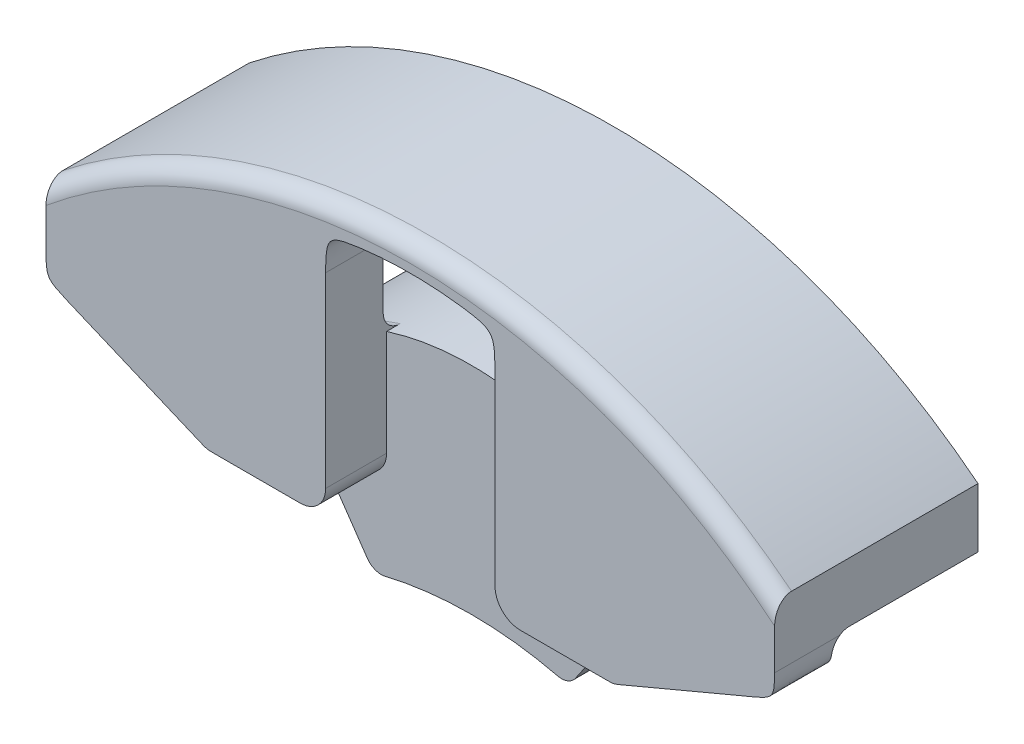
ISO-10303-21;
HEADER;
FILE_DESCRIPTION(('STEP AP214'),'2;1');
FILE_NAME('part.step','',(''),(''),'','','');
FILE_SCHEMA(('AUTOMOTIVE_DESIGN { 1 0 10303 214 1 1 1 1 }'));
ENDSEC;
DATA;
#1=APPLICATION_CONTEXT('core data for automotive mechanical design processes');
#2=APPLICATION_PROTOCOL_DEFINITION('international standard','automotive_design',2000,#1);
#3=PRODUCT_CONTEXT('',#1,'mechanical');
#4=PRODUCT('Part','Part','',(#3));
#5=PRODUCT_RELATED_PRODUCT_CATEGORY('part','',(#4));
#6=PRODUCT_DEFINITION_FORMATION('','',#4);
#7=PRODUCT_DEFINITION_CONTEXT('part definition',#1,'design');
#8=PRODUCT_DEFINITION('design','',#6,#7);
#9=PRODUCT_DEFINITION_SHAPE('','',#8);
#10=(LENGTH_UNIT() NAMED_UNIT(*) SI_UNIT(.MILLI.,.METRE.));
#11=(NAMED_UNIT(*) PLANE_ANGLE_UNIT() SI_UNIT($,.RADIAN.));
#12=(NAMED_UNIT(*) SI_UNIT($,.STERADIAN.) SOLID_ANGLE_UNIT());
#13=UNCERTAINTY_MEASURE_WITH_UNIT(LENGTH_MEASURE(1.E-05),#10,'distance_accuracy_value','');
#14=(GEOMETRIC_REPRESENTATION_CONTEXT(3) GLOBAL_UNCERTAINTY_ASSIGNED_CONTEXT((#13)) GLOBAL_UNIT_ASSIGNED_CONTEXT((#10,
#11,#12)) REPRESENTATION_CONTEXT('',''));
#15=CARTESIAN_POINT('',(0.,0.,0.));
#16=DIRECTION('',(0.,0.,1.));
#17=DIRECTION('',(1.,0.,0.));
#18=AXIS2_PLACEMENT_3D('',#15,#16,#17);
#19=CARTESIAN_POINT('',(-12.,0.,12.));
#20=DIRECTION('',(0.,1.,0.));
#21=DIRECTION('',(0.,0.,1.));
#22=AXIS2_PLACEMENT_3D('',#19,#20,#21);
#23=PLANE('',#22);
#24=DIRECTION('',(-1.,0.,0.));
#25=VECTOR('',#24,1.);
#26=CARTESIAN_POINT('',(-8.5,0.,3.8));
#27=LINE('',#26,#25);
#28=CARTESIAN_POINT('',(-6.5,0.,3.8));
#29=VERTEX_POINT('',#28);
#30=CARTESIAN_POINT('',(-8.5,0.,3.8));
#31=VERTEX_POINT('',#30);
#32=EDGE_CURVE('E468',#29,#31,#27,.T.);
#33=ORIENTED_EDGE('',*,*,#32,.T.);
#34=DIRECTION('',(0.,0.,1.));
#35=VECTOR('',#34,1.);
#36=CARTESIAN_POINT('',(-8.5,0.,3.8));
#37=LINE('',#36,#35);
#38=CARTESIAN_POINT('',(-8.5,0.,8.4));
#39=VERTEX_POINT('',#38);
#40=EDGE_CURVE('E487',#31,#39,#37,.T.);
#41=ORIENTED_EDGE('',*,*,#40,.T.);
#42=DIRECTION('',(-1.,0.,0.));
#43=VECTOR('',#42,1.);
#44=CARTESIAN_POINT('',(-8.5,0.,8.4));
#45=LINE('',#44,#43);
#46=CARTESIAN_POINT('',(-6.5,0.,8.4));
#47=VERTEX_POINT('',#46);
#48=EDGE_CURVE('E502',#47,#39,#45,.T.);
#49=ORIENTED_EDGE('',*,*,#48,.F.);
#50=DIRECTION('',(0.,0.,-1.));
#51=VECTOR('',#50,1.);
#52=CARTESIAN_POINT('',(-6.5,0.,12.));
#53=LINE('',#52,#51);
#54=CARTESIAN_POINT('',(-6.5,0.,12.));
#55=VERTEX_POINT('',#54);
#56=EDGE_CURVE('E1124',#47,#55,#53,.F.);
#57=ORIENTED_EDGE('',*,*,#56,.T.);
#58=DIRECTION('',(1.,0.,0.));
#59=VECTOR('',#58,1.);
#60=CARTESIAN_POINT('',(-12.,0.,12.));
#61=LINE('',#60,#59);
#62=CARTESIAN_POINT('',(-11.5961179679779,0.,12.));
#63=VERTEX_POINT('',#62);
#64=EDGE_CURVE('E1402',#63,#55,#61,.T.);
#65=ORIENTED_EDGE('',*,*,#64,.F.);
#66=CARTESIAN_POINT('',(-11.5961179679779,0.,-0.6));
#67=CARTESIAN_POINT('',(-11.5961179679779,0.,3.8));
#68=CARTESIAN_POINT('',(-11.5961179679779,0.,8.2));
#69=CARTESIAN_POINT('',(-11.5961179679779,0.,12.6));
#70=(BOUNDED_CURVE() B_SPLINE_CURVE(3,(#66,#67,#68,#69),.UNSPECIFIED.,.F.,
.F.) B_SPLINE_CURVE_WITH_KNOTS((4,4),(-0.0126,0.0006),
.UNSPECIFIED.) CURVE() GEOMETRIC_REPRESENTATION_ITEM() RATIONAL_B_SPLINE_CURVE((1.,1.,1.,1.)) REPRESENTATION_ITEM(''));
#71=CARTESIAN_POINT('',(-11.5961179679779,0.,0.));
#72=VERTEX_POINT('',#71);
#73=EDGE_CURVE('E1398',#63,#72,#70,.F.);
#74=ORIENTED_EDGE('',*,*,#73,.T.);
#75=DIRECTION('',(1.,0.,0.));
#76=VECTOR('',#75,1.);
#77=CARTESIAN_POINT('',(-12.,0.,0.));
#78=LINE('',#77,#76);
#79=CARTESIAN_POINT('',(-6.5,0.,0.));
#80=VERTEX_POINT('',#79);
#81=EDGE_CURVE('E1141',#72,#80,#78,.T.);
#82=ORIENTED_EDGE('',*,*,#81,.T.);
#83=EDGE_CURVE('E1121',#80,#29,#53,.F.);
#84=ORIENTED_EDGE('',*,*,#83,.T.);
#85=EDGE_LOOP('',(#33,#41,#49,#57,#65,#74,#82,#84));
#86=FACE_BOUND('',#85,.T.);
#87=ADVANCED_FACE('F72',(#86),#23,.F.);
#88=DIRECTION('',(-1.,0.,0.));
#89=VECTOR('',#88,1.);
#90=CARTESIAN_POINT('',(6.5,0.,3.8));
#91=LINE('',#90,#89);
#92=CARTESIAN_POINT('',(8.49999999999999,0.,3.8));
#93=VERTEX_POINT('',#92);
#94=CARTESIAN_POINT('',(6.5,0.,3.8));
#95=VERTEX_POINT('',#94);
#96=EDGE_CURVE('E485',#93,#95,#91,.T.);
#97=ORIENTED_EDGE('',*,*,#96,.T.);
#98=DIRECTION('',(0.,0.,-1.));
#99=VECTOR('',#98,1.);
#100=CARTESIAN_POINT('',(6.5,0.,12.));
#101=LINE('',#100,#99);
#102=CARTESIAN_POINT('',(6.5,0.,0.));
#103=VERTEX_POINT('',#102);
#104=EDGE_CURVE('E1112',#95,#103,#101,.T.);
#105=ORIENTED_EDGE('',*,*,#104,.T.);
#106=CARTESIAN_POINT('',(11.5961179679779,0.,0.));
#107=VERTEX_POINT('',#106);
#108=EDGE_CURVE('E1093',#103,#107,#78,.T.);
#109=ORIENTED_EDGE('',*,*,#108,.T.);
#110=CARTESIAN_POINT('',(11.5961179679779,0.,12.6));
#111=CARTESIAN_POINT('',(11.5961179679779,0.,8.2));
#112=CARTESIAN_POINT('',(11.5961179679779,0.,3.8));
#113=CARTESIAN_POINT('',(11.5961179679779,0.,-0.6));
#114=(BOUNDED_CURVE() B_SPLINE_CURVE(3,(#110,#111,#112,#113),.UNSPECIFIED.,.F.,
.F.) B_SPLINE_CURVE_WITH_KNOTS((4,4),(-0.0126,0.0006),
.UNSPECIFIED.) CURVE() GEOMETRIC_REPRESENTATION_ITEM() RATIONAL_B_SPLINE_CURVE((1.,1.,1.,1.)) REPRESENTATION_ITEM(''));
#115=CARTESIAN_POINT('',(11.5961179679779,0.,12.));
#116=VERTEX_POINT('',#115);
#117=EDGE_CURVE('E722',#107,#116,#114,.F.);
#118=ORIENTED_EDGE('',*,*,#117,.T.);
#119=CARTESIAN_POINT('',(6.5,0.,12.));
#120=VERTEX_POINT('',#119);
#121=EDGE_CURVE('E1687',#120,#116,#61,.T.);
#122=ORIENTED_EDGE('',*,*,#121,.F.);
#123=CARTESIAN_POINT('',(6.5,0.,8.4));
#124=VERTEX_POINT('',#123);
#125=EDGE_CURVE('E1108',#120,#124,#101,.T.);
#126=ORIENTED_EDGE('',*,*,#125,.T.);
#127=DIRECTION('',(-1.,0.,0.));
#128=VECTOR('',#127,1.);
#129=CARTESIAN_POINT('',(6.5,0.,8.4));
#130=LINE('',#129,#128);
#131=CARTESIAN_POINT('',(8.5,0.,8.4));
#132=VERTEX_POINT('',#131);
#133=EDGE_CURVE('E519',#132,#124,#130,.T.);
#134=ORIENTED_EDGE('',*,*,#133,.F.);
#135=DIRECTION('',(0.,0.,1.));
#136=VECTOR('',#135,1.);
#137=CARTESIAN_POINT('',(8.49999999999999,0.,3.8));
#138=LINE('',#137,#136);
#139=EDGE_CURVE('E522',#93,#132,#138,.T.);
#140=ORIENTED_EDGE('',*,*,#139,.F.);
#141=EDGE_LOOP('',(#97,#105,#109,#118,#122,#126,#134,#140));
#142=FACE_BOUND('',#141,.T.);
#143=ADVANCED_FACE('F739',(#142),#23,.F.);
#144=CARTESIAN_POINT('',(-5.,14.4499443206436,12.));
#145=DIRECTION('',(1.,0.,0.));
#146=DIRECTION('',(0.,1.,0.));
#147=AXIS2_PLACEMENT_3D('',#144,#145,#146);
#148=PLANE('',#147);
#149=DIRECTION('',(0.,0.,-1.));
#150=VECTOR('',#149,1.);
#151=CARTESIAN_POINT('',(-5.,7.72418519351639,59.4341649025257));
#152=LINE('',#151,#150);
#153=CARTESIAN_POINT('',(-5.,7.72418519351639,3.8));
#154=VERTEX_POINT('',#153);
#155=CARTESIAN_POINT('',(-5.,7.72418519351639,0.));
#156=VERTEX_POINT('',#155);
#157=EDGE_CURVE('E548',#154,#156,#152,.T.);
#158=ORIENTED_EDGE('',*,*,#157,.F.);
#159=DIRECTION('',(0.,-1.,0.));
#160=VECTOR('',#159,1.);
#161=CARTESIAN_POINT('',(-5.,7.72418519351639,3.8));
#162=LINE('',#161,#160);
#163=CARTESIAN_POINT('',(-5.,1.5,3.8));
#164=VERTEX_POINT('',#163);
#165=EDGE_CURVE('E459',#154,#164,#162,.T.);
#166=ORIENTED_EDGE('',*,*,#165,.T.);
#167=DIRECTION('',(0.,0.,-1.));
#168=VECTOR('',#167,1.);
#169=CARTESIAN_POINT('',(-5.,1.5,0.));
#170=LINE('',#169,#168);
#171=CARTESIAN_POINT('',(-5.,1.5,0.));
#172=VERTEX_POINT('',#171);
#173=EDGE_CURVE('E1134',#164,#172,#170,.T.);
#174=ORIENTED_EDGE('',*,*,#173,.T.);
#175=DIRECTION('',(0.,-1.,0.));
#176=VECTOR('',#175,1.);
#177=CARTESIAN_POINT('',(-5.,14.4499443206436,0.));
#178=LINE('',#177,#176);
#179=EDGE_CURVE('E1408',#156,#172,#178,.T.);
#180=ORIENTED_EDGE('',*,*,#179,.F.);
#181=EDGE_LOOP('',(#158,#166,#174,#180));
#182=FACE_BOUND('',#181,.T.);
#183=ADVANCED_FACE('F1755',(#182),#148,.T.);
#184=CARTESIAN_POINT('',(5.,14.4499443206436,12.));
#185=DIRECTION('',(1.,0.,0.));
#186=DIRECTION('',(0.,1.,0.));
#187=AXIS2_PLACEMENT_3D('',#184,#185,#186);
#188=PLANE('',#187);
#189=DIRECTION('',(0.,1.,0.));
#190=VECTOR('',#189,1.);
#191=CARTESIAN_POINT('',(5.,7.7241851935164,3.8));
#192=LINE('',#191,#190);
#193=CARTESIAN_POINT('',(5.,1.5,3.8));
#194=VERTEX_POINT('',#193);
#195=CARTESIAN_POINT('',(5.,7.72418519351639,3.8));
#196=VERTEX_POINT('',#195);
#197=EDGE_CURVE('E448',#194,#196,#192,.T.);
#198=ORIENTED_EDGE('',*,*,#197,.T.);
#199=DIRECTION('',(0.,0.,-1.));
#200=VECTOR('',#199,1.);
#201=CARTESIAN_POINT('',(5.,7.7241851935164,59.4341649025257));
#202=LINE('',#201,#200);
#203=CARTESIAN_POINT('',(5.,7.7241851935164,0.));
#204=VERTEX_POINT('',#203);
#205=EDGE_CURVE('E432',#196,#204,#202,.T.);
#206=ORIENTED_EDGE('',*,*,#205,.T.);
#207=DIRECTION('',(0.,-1.,0.));
#208=VECTOR('',#207,1.);
#209=CARTESIAN_POINT('',(5.,14.4499443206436,0.));
#210=LINE('',#209,#208);
#211=CARTESIAN_POINT('',(5.,1.5,0.));
#212=VERTEX_POINT('',#211);
#213=EDGE_CURVE('E1551',#204,#212,#210,.T.);
#214=ORIENTED_EDGE('',*,*,#213,.T.);
#215=DIRECTION('',(0.,0.,-1.));
#216=VECTOR('',#215,1.);
#217=CARTESIAN_POINT('',(5.,1.5,12.));
#218=LINE('',#217,#216);
#219=EDGE_CURVE('E451',#212,#194,#218,.F.);
#220=ORIENTED_EDGE('',*,*,#219,.T.);
#221=EDGE_LOOP('',(#198,#206,#214,#220));
#222=FACE_BOUND('',#221,.T.);
#223=ADVANCED_FACE('F449',(#222),#188,.F.);
#224=CARTESIAN_POINT('',(-6.5,1.5,12.));
#225=DIRECTION('',(0.,0.,1.));
#226=DIRECTION('',(1.,0.,0.));
#227=AXIS2_PLACEMENT_3D('',#224,#225,#226);
#228=CYLINDRICAL_SURFACE('',#227,1.5);
#229=ORIENTED_EDGE('',*,*,#173,.F.);
#230=CARTESIAN_POINT('',(-6.5,1.5,3.8));
#231=DIRECTION('',(0.,0.,-1.));
#232=DIRECTION('',(1.,0.,0.));
#233=AXIS2_PLACEMENT_3D('',#230,#231,#232);
#234=CIRCLE('',#233,1.5);
#235=EDGE_CURVE('E462',#164,#29,#234,.T.);
#236=ORIENTED_EDGE('',*,*,#235,.T.);
#237=ORIENTED_EDGE('',*,*,#83,.F.);
#238=CARTESIAN_POINT('',(-6.5,1.5,0.));
#239=DIRECTION('',(0.,0.,-1.));
#240=DIRECTION('',(-1.,0.,0.));
#241=AXIS2_PLACEMENT_3D('',#238,#239,#240);
#242=CIRCLE('',#241,1.5);
#243=EDGE_CURVE('E1125',#172,#80,#242,.T.);
#244=ORIENTED_EDGE('',*,*,#243,.F.);
#245=EDGE_LOOP('',(#229,#236,#237,#244));
#246=FACE_BOUND('',#245,.T.);
#247=ADVANCED_FACE('F1411',(#246),#228,.T.);
#248=CARTESIAN_POINT('',(6.5,1.5,12.));
#249=DIRECTION('',(0.,0.,-1.));
#250=DIRECTION('',(-1.,0.,0.));
#251=AXIS2_PLACEMENT_3D('',#248,#249,#250);
#252=CYLINDRICAL_SURFACE('',#251,1.5);
#253=ORIENTED_EDGE('',*,*,#104,.F.);
#254=CARTESIAN_POINT('',(6.5,1.5,3.8));
#255=DIRECTION('',(0.,0.,-1.));
#256=DIRECTION('',(1.,0.,0.));
#257=AXIS2_PLACEMENT_3D('',#254,#255,#256);
#258=CIRCLE('',#257,1.5);
#259=EDGE_CURVE('E454',#95,#194,#258,.T.);
#260=ORIENTED_EDGE('',*,*,#259,.T.);
#261=ORIENTED_EDGE('',*,*,#219,.F.);
#262=CARTESIAN_POINT('',(6.5,1.5,0.));
#263=DIRECTION('',(0.,0.,-1.));
#264=DIRECTION('',(-1.,0.,0.));
#265=AXIS2_PLACEMENT_3D('',#262,#263,#264);
#266=CIRCLE('',#265,1.5);
#267=EDGE_CURVE('E1128',#103,#212,#266,.T.);
#268=ORIENTED_EDGE('',*,*,#267,.F.);
#269=EDGE_LOOP('',(#253,#260,#261,#268));
#270=FACE_BOUND('',#269,.T.);
#271=ADVANCED_FACE('F1653',(#270),#252,.T.);
#272=CARTESIAN_POINT('',(0.,-18.0666666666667,0.));
#273=DIRECTION('',(0.,0.,-1.));
#274=DIRECTION('',(-1.,0.,0.));
#275=AXIS2_PLACEMENT_3D('',#272,#273,#274);
#276=PLANE('',#275);
#277=DIRECTION('',(-0.224951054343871,-0.974370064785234,0.));
#278=VECTOR('',#277,1.);
#279=CARTESIAN_POINT('',(-12.,0.,0.));
#280=LINE('',#279,#278);
#281=CARTESIAN_POINT('',(-11.1572082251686,3.65053223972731,0.));
#282=VERTEX_POINT('',#281);
#283=CARTESIAN_POINT('',(-11.9946026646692,0.0233784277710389,0.));
#284=VERTEX_POINT('',#283);
#285=EDGE_CURVE('E543',#282,#284,#280,.T.);
#286=ORIENTED_EDGE('',*,*,#285,.F.);
#287=CARTESIAN_POINT('',(-9.20846809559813,3.20063013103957,0.));
#288=DIRECTION('',(0.,0.,1.));
#289=DIRECTION('',(1.,0.,0.));
#290=AXIS2_PLACEMENT_3D('',#287,#288,#289);
#291=CIRCLE('',#290,2.);
#292=CARTESIAN_POINT('',(-10.4786016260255,4.74554463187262,0.));
#293=VERTEX_POINT('',#292);
#294=EDGE_CURVE('E547',#293,#282,#291,.T.);
#295=ORIENTED_EDGE('',*,*,#294,.F.);
#296=CARTESIAN_POINT('',(0.,-8.,0.));
#297=DIRECTION('',(0.,0.,1.));
#298=DIRECTION('',(-1.,0.,0.));
#299=AXIS2_PLACEMENT_3D('',#296,#297,#298);
#300=CIRCLE('',#299,16.5);
#301=EDGE_CURVE('E1549',#156,#293,#300,.T.);
#302=ORIENTED_EDGE('',*,*,#301,.F.);
#303=ORIENTED_EDGE('',*,*,#179,.T.);
#304=ORIENTED_EDGE('',*,*,#243,.T.);
#305=ORIENTED_EDGE('',*,*,#81,.F.);
#306=CARTESIAN_POINT('',(-12.3722319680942,0.156729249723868,0.));
#307=CARTESIAN_POINT('',(-12.,0.,0.));
#308=CARTESIAN_POINT('',(-11.5961179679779,0.,0.));
#309=(BOUNDED_CURVE() B_SPLINE_CURVE(2,(#306,#307,#308),.UNSPECIFIED.,.F.,
.F.) B_SPLINE_CURVE_WITH_KNOTS((3,3),(0.,1.),
.UNSPECIFIED.) CURVE() GEOMETRIC_REPRESENTATION_ITEM() RATIONAL_B_SPLINE_CURVE((1.,
2.33333333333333,1.)) REPRESENTATION_ITEM(''));
#310=EDGE_CURVE('E1103',#72,#284,#309,.F.);
#311=ORIENTED_EDGE('',*,*,#310,.T.);
#312=EDGE_LOOP('',(#286,#295,#302,#303,#304,#305,#311));
#313=FACE_BOUND('',#312,.T.);
#314=ADVANCED_FACE('F685',(#313),#276,.T.);
#315=CARTESIAN_POINT('',(10.4786016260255,4.74554463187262,0.));
#316=VERTEX_POINT('',#315);
#317=EDGE_CURVE('E440',#316,#204,#300,.T.);
#318=ORIENTED_EDGE('',*,*,#317,.F.);
#319=CARTESIAN_POINT('',(9.20846809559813,3.20063013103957,0.));
#320=DIRECTION('',(0.,0.,1.));
#321=DIRECTION('',(-1.,0.,0.));
#322=AXIS2_PLACEMENT_3D('',#319,#320,#321);
#323=CIRCLE('',#322,2.);
#324=CARTESIAN_POINT('',(11.1572082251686,3.65053223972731,0.));
#325=VERTEX_POINT('',#324);
#326=EDGE_CURVE('E535',#325,#316,#323,.T.);
#327=ORIENTED_EDGE('',*,*,#326,.F.);
#328=DIRECTION('',(-0.22495105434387,0.974370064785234,0.));
#329=VECTOR('',#328,1.);
#330=CARTESIAN_POINT('',(12.,0.,0.));
#331=LINE('',#330,#329);
#332=CARTESIAN_POINT('',(11.9946026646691,0.0233784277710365,0.));
#333=VERTEX_POINT('',#332);
#334=EDGE_CURVE('E532',#333,#325,#331,.T.);
#335=ORIENTED_EDGE('',*,*,#334,.F.);
#336=CARTESIAN_POINT('',(11.5961179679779,0.,0.));
#337=CARTESIAN_POINT('',(12.,0.,0.));
#338=CARTESIAN_POINT('',(12.3722319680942,0.156729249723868,0.));
#339=CARTESIAN_POINT('',(12.3809173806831,0.160386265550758,0.));
#340=CARTESIAN_POINT('',(12.3896027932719,0.164043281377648,0.));
#341=(BOUNDED_CURVE() B_SPLINE_CURVE(2,(#336,#337,#338,#339,#340),.UNSPECIFIED.,.F.,
.F.) B_SPLINE_CURVE_WITH_KNOTS((3,2,3),(0.,1.,1.01),
.UNSPECIFIED.) CURVE() GEOMETRIC_REPRESENTATION_ITEM() RATIONAL_B_SPLINE_CURVE((1.,
2.33333333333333,1.,1.,1.)) REPRESENTATION_ITEM(''));
#342=EDGE_CURVE('E1105',#333,#107,#341,.F.);
#343=ORIENTED_EDGE('',*,*,#342,.T.);
#344=ORIENTED_EDGE('',*,*,#108,.F.);
#345=ORIENTED_EDGE('',*,*,#267,.T.);
#346=ORIENTED_EDGE('',*,*,#213,.F.);
#347=EDGE_LOOP('',(#318,#327,#335,#343,#344,#345,#346));
#348=FACE_BOUND('',#347,.T.);
#349=ADVANCED_FACE('F1550',(#348),#276,.T.);
#350=CARTESIAN_POINT('',(24.3285980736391,17.1618623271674,0.));
#351=DIRECTION('',(0.,0.,1.));
#352=DIRECTION('',(1.,0.,0.));
#353=AXIS2_PLACEMENT_3D('',#350,#351,#352);
#354=CIRCLE('',#353,12.);
#355=CARTESIAN_POINT('',(15.9873644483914,8.53493810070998,0.));
#356=VERTEX_POINT('',#355);
#357=CARTESIAN_POINT('',(21.5,5.50000000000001,0.));
#358=VERTEX_POINT('',#357);
#359=EDGE_CURVE('E530',#356,#358,#354,.T.);
#360=ORIENTED_EDGE('',*,*,#359,.F.);
#361=CARTESIAN_POINT('',(0.,-8.,0.));
#362=DIRECTION('',(0.,0.,1.));
#363=DIRECTION('',(1.,0.,0.));
#364=AXIS2_PLACEMENT_3D('',#361,#362,#363);
#365=CIRCLE('',#364,23.);
#366=CARTESIAN_POINT('',(-15.9873644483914,8.53493810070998,0.));
#367=VERTEX_POINT('',#366);
#368=EDGE_CURVE('E914',#356,#367,#365,.T.);
#369=ORIENTED_EDGE('',*,*,#368,.T.);
#370=CARTESIAN_POINT('',(-24.3285980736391,17.1618623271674,0.));
#371=DIRECTION('',(0.,0.,1.));
#372=DIRECTION('',(-1.,0.,0.));
#373=AXIS2_PLACEMENT_3D('',#370,#371,#372);
#374=CIRCLE('',#373,12.);
#375=CARTESIAN_POINT('',(-21.5,5.50000000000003,0.));
#376=VERTEX_POINT('',#375);
#377=EDGE_CURVE('E525',#376,#367,#374,.T.);
#378=ORIENTED_EDGE('',*,*,#377,.F.);
#379=DIRECTION('',(0.,-1.,0.));
#380=VECTOR('',#379,1.);
#381=CARTESIAN_POINT('',(-21.5,9.00000000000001,0.));
#382=LINE('',#381,#380);
#383=CARTESIAN_POINT('',(-21.5,9.00000000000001,0.));
#384=VERTEX_POINT('',#383);
#385=EDGE_CURVE('E1139',#384,#376,#382,.T.);
#386=ORIENTED_EDGE('',*,*,#385,.F.);
#387=CARTESIAN_POINT('',(0.,-18.0666666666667,0.));
#388=DIRECTION('',(0.,0.,-1.));
#389=DIRECTION('',(-1.,0.,0.));
#390=AXIS2_PLACEMENT_3D('',#387,#388,#389);
#391=CIRCLE('',#390,34.5666666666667);
#392=CARTESIAN_POINT('',(21.5,9.00000000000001,0.));
#393=VERTEX_POINT('',#392);
#394=EDGE_CURVE('E942',#384,#393,#391,.T.);
#395=ORIENTED_EDGE('',*,*,#394,.T.);
#396=DIRECTION('',(0.,-1.,0.));
#397=VECTOR('',#396,1.);
#398=CARTESIAN_POINT('',(21.5,9.00000000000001,0.));
#399=LINE('',#398,#397);
#400=EDGE_CURVE('E1085',#393,#358,#399,.T.);
#401=ORIENTED_EDGE('',*,*,#400,.T.);
#402=EDGE_LOOP('',(#360,#369,#378,#386,#395,#401));
#403=FACE_BOUND('',#402,.T.);
#404=ADVANCED_FACE('F1608',(#403),#276,.T.);
#405=CARTESIAN_POINT('',(-12.,0.,12.));
#406=DIRECTION('',(-0.388057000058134,-0.921635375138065,0.));
#407=DIRECTION('',(0.921635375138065,-0.388057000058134,0.));
#408=AXIS2_PLACEMENT_3D('',#405,#406,#407);
#409=PLANE('',#408);
#410=CARTESIAN_POINT('',(-20.2761140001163,3.48467957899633,-0.599999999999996));
#411=CARTESIAN_POINT('',(-20.2761140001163,3.48467957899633,3.80000000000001));
#412=CARTESIAN_POINT('',(-20.2761140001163,3.48467957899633,8.2));
#413=CARTESIAN_POINT('',(-20.2761140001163,3.48467957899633,12.6));
#414=(BOUNDED_CURVE() B_SPLINE_CURVE(3,(#410,#411,#412,#413),.UNSPECIFIED.,.F.,
.F.) B_SPLINE_CURVE_WITH_KNOTS((4,4),(-0.0126,0.0006),
.UNSPECIFIED.) CURVE() GEOMETRIC_REPRESENTATION_ITEM() RATIONAL_B_SPLINE_CURVE((1.,1.,1.,1.)) REPRESENTATION_ITEM(''));
#415=CARTESIAN_POINT('',(-20.2761140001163,3.48467957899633,12.));
#416=VERTEX_POINT('',#415);
#417=CARTESIAN_POINT('',(-20.2761140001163,3.48467957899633,8.6));
#418=VERTEX_POINT('',#417);
#419=EDGE_CURVE('E759',#416,#418,#414,.F.);
#420=ORIENTED_EDGE('',*,*,#419,.T.);
#421=DIRECTION('',(0.921635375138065,-0.388057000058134,0.));
#422=VECTOR('',#421,1.);
#423=CARTESIAN_POINT('',(-12.,0.,8.6));
#424=LINE('',#423,#422);
#425=CARTESIAN_POINT('',(-12.935378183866,0.393843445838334,8.6));
#426=VERTEX_POINT('',#425);
#427=EDGE_CURVE('E555',#418,#426,#424,.T.);
#428=ORIENTED_EDGE('',*,*,#427,.T.);
#429=CARTESIAN_POINT('',(-12.935378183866,0.393843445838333,7.6));
#430=DIRECTION('',(-0.388057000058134,-0.921635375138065,0.));
#431=DIRECTION('',(-0.921635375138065,0.388057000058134,0.));
#432=AXIS2_PLACEMENT_3D('',#429,#430,#431);
#433=ELLIPSE('',#432,1.01491132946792,1.);
#434=CARTESIAN_POINT('',(-12.3722319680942,0.156729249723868,8.39845713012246));
#435=VERTEX_POINT('',#434);
#436=EDGE_CURVE('E95',#426,#435,#433,.F.);
#437=ORIENTED_EDGE('',*,*,#436,.T.);
#438=CARTESIAN_POINT('',(-12.3722319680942,0.156729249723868,12.6));
#439=CARTESIAN_POINT('',(-12.3722319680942,0.156729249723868,8.2));
#440=CARTESIAN_POINT('',(-12.3722319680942,0.156729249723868,3.8));
#441=CARTESIAN_POINT('',(-12.3722319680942,0.156729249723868,-0.6));
#442=(BOUNDED_CURVE() B_SPLINE_CURVE(3,(#438,#439,#440,#441),.UNSPECIFIED.,.F.,
.F.) B_SPLINE_CURVE_WITH_KNOTS((4,4),(-0.0126,0.0006),
.UNSPECIFIED.) CURVE() GEOMETRIC_REPRESENTATION_ITEM() RATIONAL_B_SPLINE_CURVE((1.,1.,1.,1.)) REPRESENTATION_ITEM(''));
#443=CARTESIAN_POINT('',(-12.3722319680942,0.156729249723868,8.6));
#444=VERTEX_POINT('',#443);
#445=EDGE_CURVE('E81',#444,#435,#442,.T.);
#446=ORIENTED_EDGE('',*,*,#445,.F.);
#447=CARTESIAN_POINT('',(-12.3722319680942,0.156729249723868,12.6));
#448=CARTESIAN_POINT('',(-12.3722319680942,0.156729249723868,8.2));
#449=CARTESIAN_POINT('',(-12.3722319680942,0.156729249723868,3.8));
#450=CARTESIAN_POINT('',(-12.3722319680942,0.156729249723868,-0.6));
#451=(BOUNDED_CURVE() B_SPLINE_CURVE(3,(#447,#448,#449,#450),.UNSPECIFIED.,.F.,
.F.) B_SPLINE_CURVE_WITH_KNOTS((4,4),(-0.0126,0.0006),
.UNSPECIFIED.) CURVE() GEOMETRIC_REPRESENTATION_ITEM() RATIONAL_B_SPLINE_CURVE((1.,1.,1.,1.)) REPRESENTATION_ITEM(''));
#452=CARTESIAN_POINT('',(-12.3722319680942,0.156729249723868,12.));
#453=VERTEX_POINT('',#452);
#454=EDGE_CURVE('E1394',#444,#453,#451,.F.);
#455=ORIENTED_EDGE('',*,*,#454,.T.);
#456=DIRECTION('',(-0.921635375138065,0.388057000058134,0.));
#457=VECTOR('',#456,1.);
#458=CARTESIAN_POINT('',(-12.,0.,12.));
#459=LINE('',#458,#457);
#460=EDGE_CURVE('E1077',#453,#416,#459,.T.);
#461=ORIENTED_EDGE('',*,*,#460,.T.);
#462=EDGE_LOOP('',(#420,#428,#437,#446,#455,#461));
#463=FACE_BOUND('',#462,.T.);
#464=ADVANCED_FACE('F741',(#463),#409,.T.);
#465=CARTESIAN_POINT('',(21.5,4.00000000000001,12.));
#466=DIRECTION('',(0.388057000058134,-0.921635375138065,0.));
#467=DIRECTION('',(0.921635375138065,0.388057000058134,0.));
#468=AXIS2_PLACEMENT_3D('',#465,#466,#467);
#469=PLANE('',#468);
#470=CARTESIAN_POINT('',(12.3722319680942,0.156729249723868,-0.6));
#471=CARTESIAN_POINT('',(12.3722319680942,0.156729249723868,3.8));
#472=CARTESIAN_POINT('',(12.3722319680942,0.156729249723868,8.2));
#473=CARTESIAN_POINT('',(12.3722319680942,0.156729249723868,12.6));
#474=(BOUNDED_CURVE() B_SPLINE_CURVE(3,(#470,#471,#472,#473),.UNSPECIFIED.,.F.,
.F.) B_SPLINE_CURVE_WITH_KNOTS((4,4),(-0.0126,0.0006),
.UNSPECIFIED.) CURVE() GEOMETRIC_REPRESENTATION_ITEM() RATIONAL_B_SPLINE_CURVE((1.,1.,1.,1.)) REPRESENTATION_ITEM(''));
#475=CARTESIAN_POINT('',(12.3722319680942,0.156729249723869,12.));
#476=VERTEX_POINT('',#475);
#477=CARTESIAN_POINT('',(12.3722319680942,0.156729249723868,8.6));
#478=VERTEX_POINT('',#477);
#479=EDGE_CURVE('E1242',#476,#478,#474,.F.);
#480=ORIENTED_EDGE('',*,*,#479,.T.);
#481=CARTESIAN_POINT('',(12.3722319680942,0.156729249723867,-0.6));
#482=CARTESIAN_POINT('',(12.3722319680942,0.156729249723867,3.8));
#483=CARTESIAN_POINT('',(12.3722319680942,0.156729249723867,8.2));
#484=CARTESIAN_POINT('',(12.3722319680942,0.156729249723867,12.6));
#485=(BOUNDED_CURVE() B_SPLINE_CURVE(3,(#481,#482,#483,#484),.UNSPECIFIED.,.F.,
.F.) B_SPLINE_CURVE_WITH_KNOTS((4,4),(-0.0126,0.0006),
.UNSPECIFIED.) CURVE() GEOMETRIC_REPRESENTATION_ITEM() RATIONAL_B_SPLINE_CURVE((1.,1.,1.,1.)) REPRESENTATION_ITEM(''));
#486=CARTESIAN_POINT('',(12.3722319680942,0.156729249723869,8.39845713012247));
#487=VERTEX_POINT('',#486);
#488=EDGE_CURVE('E1232',#478,#487,#485,.F.);
#489=ORIENTED_EDGE('',*,*,#488,.T.);
#490=CARTESIAN_POINT('',(12.935378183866,0.393843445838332,7.6));
#491=DIRECTION('',(0.388057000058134,-0.921635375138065,0.));
#492=DIRECTION('',(-0.921635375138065,-0.388057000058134,0.));
#493=AXIS2_PLACEMENT_3D('',#490,#491,#492);
#494=ELLIPSE('',#493,1.01491132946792,1.);
#495=CARTESIAN_POINT('',(12.935378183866,0.393843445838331,8.6));
#496=VERTEX_POINT('',#495);
#497=EDGE_CURVE('E1235',#487,#496,#494,.F.);
#498=ORIENTED_EDGE('',*,*,#497,.T.);
#499=DIRECTION('',(0.921635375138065,0.388057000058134,0.));
#500=VECTOR('',#499,1.);
#501=CARTESIAN_POINT('',(21.5,4.00000000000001,8.6));
#502=LINE('',#501,#500);
#503=CARTESIAN_POINT('',(20.2761140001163,3.48467957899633,8.6));
#504=VERTEX_POINT('',#503);
#505=EDGE_CURVE('E566',#496,#504,#502,.T.);
#506=ORIENTED_EDGE('',*,*,#505,.T.);
#507=CARTESIAN_POINT('',(20.2761140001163,3.48467957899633,12.6));
#508=CARTESIAN_POINT('',(20.2761140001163,3.48467957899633,8.2));
#509=CARTESIAN_POINT('',(20.2761140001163,3.48467957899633,3.80000000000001));
#510=CARTESIAN_POINT('',(20.2761140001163,3.48467957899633,-0.599999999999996));
#511=(BOUNDED_CURVE() B_SPLINE_CURVE(3,(#507,#508,#509,#510),.UNSPECIFIED.,.F.,
.F.) B_SPLINE_CURVE_WITH_KNOTS((4,4),(-0.0006,0.0126),
.UNSPECIFIED.) CURVE() GEOMETRIC_REPRESENTATION_ITEM() RATIONAL_B_SPLINE_CURVE((1.,1.,1.,1.)) REPRESENTATION_ITEM(''));
#512=CARTESIAN_POINT('',(20.2761140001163,3.48467957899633,12.));
#513=VERTEX_POINT('',#512);
#514=EDGE_CURVE('E968',#504,#513,#511,.F.);
#515=ORIENTED_EDGE('',*,*,#514,.T.);
#516=DIRECTION('',(-0.921635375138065,-0.388057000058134,0.));
#517=VECTOR('',#516,1.);
#518=CARTESIAN_POINT('',(21.5,4.00000000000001,12.));
#519=LINE('',#518,#517);
#520=EDGE_CURVE('E1158',#513,#476,#519,.T.);
#521=ORIENTED_EDGE('',*,*,#520,.T.);
#522=EDGE_LOOP('',(#480,#489,#498,#506,#515,#521));
#523=FACE_BOUND('',#522,.T.);
#524=ADVANCED_FACE('F743',(#523),#469,.T.);
#525=CARTESIAN_POINT('',(21.5,5.32795032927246,12.6));
#526=CARTESIAN_POINT('',(21.5,5.32795032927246,8.2));
#527=CARTESIAN_POINT('',(21.5,5.32795032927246,3.80000000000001));
#528=CARTESIAN_POINT('',(21.5,5.32795032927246,-0.599999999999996));
#529=CARTESIAN_POINT('',(21.5,4.00000000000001,12.6));
#530=CARTESIAN_POINT('',(21.5,4.00000000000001,8.2));
#531=CARTESIAN_POINT('',(21.5,4.00000000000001,3.80000000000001));
#532=CARTESIAN_POINT('',(21.5,4.00000000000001,-0.599999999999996));
#533=CARTESIAN_POINT('',(20.2761140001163,3.48467957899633,12.6));
#534=CARTESIAN_POINT('',(20.2761140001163,3.48467957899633,8.2));
#535=CARTESIAN_POINT('',(20.2761140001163,3.48467957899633,3.80000000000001));
#536=CARTESIAN_POINT('',(20.2761140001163,3.48467957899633,-0.599999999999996));
#537=(BOUNDED_SURFACE() B_SPLINE_SURFACE(2,3,((#525,#526,#527,#528),(#529,#530,#531,#532),(#533,
#534,#535,#536)),.UNSPECIFIED.,.F.,.F.,.F.) B_SPLINE_SURFACE_WITH_KNOTS((3,3),(4,4),(0.,1.),
(-0.0006,0.0126),.UNSPECIFIED.) GEOMETRIC_REPRESENTATION_ITEM() RATIONAL_B_SPLINE_SURFACE(((1.,
1.,1.,1.),(2.33333333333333,2.33333333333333,2.33333333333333,2.33333333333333),(1.,1.,1.,1.))) REPRESENTATION_ITEM('') SURFACE());
#538=CARTESIAN_POINT('',(20.2761140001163,3.48467957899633,8.6));
#539=CARTESIAN_POINT('',(20.3307675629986,3.50772988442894,8.6));
#540=CARTESIAN_POINT('',(20.3853238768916,3.53103275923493,8.6));
#541=CARTESIAN_POINT('',(20.4941321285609,3.57858738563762,8.6));
#542=CARTESIAN_POINT('',(20.5483833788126,3.60284070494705,8.6));
#543=CARTESIAN_POINT('',(20.656652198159,3.65283431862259,8.6));
#544=CARTESIAN_POINT('',(20.7106656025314,3.6785836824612,8.6));
#545=CARTESIAN_POINT('',(20.8176210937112,3.73217300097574,8.6));
#546=CARTESIAN_POINT('',(20.8705639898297,3.76001129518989,8.6));
#547=CARTESIAN_POINT('',(20.946966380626,3.80353843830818,8.6));
#548=CARTESIAN_POINT('',(20.9712006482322,3.81785990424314,8.6));
#549=CARTESIAN_POINT('',(21.0190296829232,3.8475063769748,8.6));
#550=CARTESIAN_POINT('',(21.0426248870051,3.86283067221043,8.6));
#551=CARTESIAN_POINT('',(21.0889789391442,3.89479421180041,8.6));
#552=CARTESIAN_POINT('',(21.1117361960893,3.91143578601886,8.6));
#553=CARTESIAN_POINT('',(21.1560167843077,3.9463520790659,8.6));
#554=CARTESIAN_POINT('',(21.1775389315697,3.96462832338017,8.6));
#555=CARTESIAN_POINT('',(21.2142854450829,3.99887215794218,8.6));
#556=CARTESIAN_POINT('',(21.2298556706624,4.0144667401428,8.6));
#557=CARTESIAN_POINT('',(21.2596424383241,4.04689599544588,8.6));
#558=CARTESIAN_POINT('',(21.2738595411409,4.06373014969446,8.6));
#559=CARTESIAN_POINT('',(21.3006807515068,4.09859279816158,8.6));
#560=CARTESIAN_POINT('',(21.3132877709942,4.11661904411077,8.6));
#561=CARTESIAN_POINT('',(21.3367794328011,4.15375944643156,8.6));
#562=CARTESIAN_POINT('',(21.3476640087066,4.17287364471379,8.6));
#563=CARTESIAN_POINT('',(21.3702728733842,4.21697820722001,8.6));
#564=CARTESIAN_POINT('',(21.3815014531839,4.24222239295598,8.6));
#565=CARTESIAN_POINT('',(21.4015310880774,4.29365986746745,8.6));
#566=CARTESIAN_POINT('',(21.4103301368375,4.31985392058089,8.6));
#567=CARTESIAN_POINT('',(21.4259745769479,4.37297463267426,8.6));
#568=CARTESIAN_POINT('',(21.4328081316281,4.39990470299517,8.6));
#569=CARTESIAN_POINT('',(21.4448869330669,4.45410554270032,8.6));
#570=CARTESIAN_POINT('',(21.450132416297,4.48137626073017,8.6));
#571=CARTESIAN_POINT('',(21.4597706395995,4.53829518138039,8.6));
#572=CARTESIAN_POINT('',(21.4640624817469,4.56796009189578,8.6));
#573=CARTESIAN_POINT('',(21.471571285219,4.6274263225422,8.6));
#574=CARTESIAN_POINT('',(21.4747880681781,4.65722766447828,8.6));
#575=CARTESIAN_POINT('',(21.4832089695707,4.74653694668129,8.6));
#576=CARTESIAN_POINT('',(21.487214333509,4.80615612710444,8.6));
#577=CARTESIAN_POINT('',(21.4922218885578,4.90426465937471,8.6));
#578=CARTESIAN_POINT('',(21.4937855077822,4.94273110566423,8.6));
#579=CARTESIAN_POINT('',(21.4963059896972,5.01968675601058,8.6));
#580=CARTESIAN_POINT('',(21.4972628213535,5.05817596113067,8.6));
#581=CARTESIAN_POINT('',(21.4987201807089,5.13521412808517,8.6));
#582=CARTESIAN_POINT('',(21.4992200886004,5.17376310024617,8.6));
#583=CARTESIAN_POINT('',(21.4998576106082,5.25085838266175,8.6));
#584=CARTESIAN_POINT('',(21.4999952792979,5.28940469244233,8.6));
#585=CARTESIAN_POINT('',(21.5,5.32795032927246,8.6));
#586=B_SPLINE_CURVE_WITH_KNOTS('',3,(#538,#539,#540,#541,#542,#543,#544,#545,#546,#547,#548,
#549,#550,#551,#552,#553,#554,#555,#556,#557,#558,#559,#560,#561,#562,#563,#564,#565,#566,#567,
#568,#569,#570,#571,#572,#573,#574,#575,#576,#577,#578,#579,#580,#581,#582,#583,#584,#585),
.UNSPECIFIED.,.F.,.F.,(4,2,2,2,2,2,2,2,2,2,2,2,2,2,2,2,2,2,2,2,2,2,2,4),(0.,0.177959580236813,
0.356226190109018,0.53571728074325,0.715067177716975,0.799498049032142,0.883869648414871,
0.968393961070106,1.05299799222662,1.11904323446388,1.18506098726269,1.25095759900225,
1.31685675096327,1.39958905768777,1.48238948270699,1.565678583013,1.64895527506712,
1.73885009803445,1.82875982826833,2.00795549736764,2.12344817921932,2.23894676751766,
2.35460179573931,2.47023939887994),.UNSPECIFIED.);
#587=CARTESIAN_POINT('',(21.4504844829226,4.48446266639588,8.6));
#588=VERTEX_POINT('',#587);
#589=EDGE_CURVE('E571',#504,#588,#586,.T.);
#590=CARTESIAN_POINT('',(21.4504844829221,4.48446266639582,8.6));
#591=CARTESIAN_POINT('',(21.4559924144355,4.51455482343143,8.6000040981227));
#592=CARTESIAN_POINT('',(21.4607227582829,4.5447683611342,8.59859889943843));
#593=CARTESIAN_POINT('',(21.4689404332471,4.60508855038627,8.59303039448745));
#594=CARTESIAN_POINT('',(21.4724287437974,4.63519526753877,8.58886926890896));
#595=CARTESIAN_POINT('',(21.4784717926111,4.69489770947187,8.57786820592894));
#596=CARTESIAN_POINT('',(21.4810297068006,4.72449483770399,8.57103754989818));
#597=CARTESIAN_POINT('',(21.4854456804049,4.78301467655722,8.55477798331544));
#598=CARTESIAN_POINT('',(21.4873036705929,4.81193732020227,8.54534881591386));
#599=CARTESIAN_POINT('',(21.4917269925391,4.89087773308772,8.51570492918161));
#600=CARTESIAN_POINT('',(21.493730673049,4.93993929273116,8.49278407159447));
#601=CARTESIAN_POINT('',(21.4967305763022,5.03391055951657,8.43959324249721));
#602=CARTESIAN_POINT('',(21.4977267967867,5.0788202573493,8.40932325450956));
#603=CARTESIAN_POINT('',(21.4990762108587,5.1608080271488,8.34413519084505));
#604=CARTESIAN_POINT('',(21.4994644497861,5.19819455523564,8.30960576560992));
#605=CARTESIAN_POINT('',(21.4999203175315,5.2674433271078,8.23535518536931));
#606=CARTESIAN_POINT('',(21.4999877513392,5.29930219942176,8.19563088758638));
#607=CARTESIAN_POINT('',(21.5,5.32794900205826,8.15368004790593));
#608=B_SPLINE_CURVE_WITH_KNOTS('',3,(#590,#591,#592,#593,#594,#595,#596,#597,#598,#599,#600,
#601,#602,#603,#604,#605,#606,#607),.UNSPECIFIED.,.F.,.F.,(4,2,2,2,2,2,2,2,4),(0.,
0.091704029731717,0.18333558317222,0.274651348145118,0.365976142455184,0.52782000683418,
0.689664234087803,0.841782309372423,0.993992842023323),.UNSPECIFIED.);
#609=CARTESIAN_POINT('',(21.5,5.32795032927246,8.15368004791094));
#610=VERTEX_POINT('',#609);
#611=EDGE_CURVE('E1025',#588,#610,#608,.T.);
#612=CARTESIAN_POINT('',(21.5,5.32795032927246,-0.599999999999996));
#613=CARTESIAN_POINT('',(21.5,5.32795032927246,3.80000000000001));
#614=CARTESIAN_POINT('',(21.5,5.32795032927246,8.2));
#615=CARTESIAN_POINT('',(21.5,5.32795032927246,12.6));
#616=(BOUNDED_CURVE() B_SPLINE_CURVE(3,(#612,#613,#614,#615),.UNSPECIFIED.,.F.,
.F.) B_SPLINE_CURVE_WITH_KNOTS((4,4),(-0.0006,0.0126),
.UNSPECIFIED.) CURVE() GEOMETRIC_REPRESENTATION_ITEM() RATIONAL_B_SPLINE_CURVE((1.,1.,1.,1.)) REPRESENTATION_ITEM(''));
#617=CARTESIAN_POINT('',(21.5,5.32795032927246,8.6));
#618=VERTEX_POINT('',#617);
#619=EDGE_CURVE('E1099',#618,#610,#616,.F.);
#620=CARTESIAN_POINT('',(21.5,5.32795032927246,-0.599999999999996));
#621=CARTESIAN_POINT('',(21.5,5.32795032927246,3.80000000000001));
#622=CARTESIAN_POINT('',(21.5,5.32795032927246,8.2));
#623=CARTESIAN_POINT('',(21.5,5.32795032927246,12.6));
#624=(BOUNDED_CURVE() B_SPLINE_CURVE(3,(#620,#621,#622,#623),.UNSPECIFIED.,.F.,
.F.) B_SPLINE_CURVE_WITH_KNOTS((4,4),(-0.0006,0.0126),
.UNSPECIFIED.) CURVE() GEOMETRIC_REPRESENTATION_ITEM() RATIONAL_B_SPLINE_CURVE((1.,1.,1.,1.)) REPRESENTATION_ITEM(''));
#625=CARTESIAN_POINT('',(21.5,5.32795032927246,12.));
#626=VERTEX_POINT('',#625);
#627=EDGE_CURVE('E1097',#626,#618,#624,.F.);
#628=CARTESIAN_POINT('',(21.5,5.32795032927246,12.));
#629=CARTESIAN_POINT('',(21.5,4.00000000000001,12.));
#630=CARTESIAN_POINT('',(20.2761140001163,3.48467957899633,12.));
#631=(BOUNDED_CURVE() B_SPLINE_CURVE(2,(#628,#629,#630),.UNSPECIFIED.,.F.,
.F.) B_SPLINE_CURVE_WITH_KNOTS((3,3),(0.,1.),
.UNSPECIFIED.) CURVE() GEOMETRIC_REPRESENTATION_ITEM() RATIONAL_B_SPLINE_CURVE((1.,
2.33333333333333,1.)) REPRESENTATION_ITEM(''));
#632=EDGE_CURVE('E1659',#513,#626,#631,.F.);
#633=ORIENTED_EDGE('',*,*,#514,.F.);
#634=ORIENTED_EDGE('',*,*,#589,.T.);
#635=ORIENTED_EDGE('',*,*,#611,.T.);
#636=ORIENTED_EDGE('',*,*,#619,.F.);
#637=ORIENTED_EDGE('',*,*,#627,.F.);
#638=ORIENTED_EDGE('',*,*,#632,.F.);
#639=EDGE_LOOP('',(#633,#634,#635,#636,#637,#638));
#640=FACE_BOUND('',#639,.T.);
#641=ADVANCED_FACE('F983',(#640),#537,.T.);
#642=CARTESIAN_POINT('',(-21.5,5.32795032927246,-0.599999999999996));
#643=CARTESIAN_POINT('',(-21.5,5.32795032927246,3.80000000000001));
#644=CARTESIAN_POINT('',(-21.5,5.32795032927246,8.2));
#645=CARTESIAN_POINT('',(-21.5,5.32795032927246,12.6));
#646=CARTESIAN_POINT('',(-21.5,4.00000000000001,-0.599999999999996));
#647=CARTESIAN_POINT('',(-21.5,4.00000000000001,3.80000000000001));
#648=CARTESIAN_POINT('',(-21.5,4.00000000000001,8.2));
#649=CARTESIAN_POINT('',(-21.5,4.00000000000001,12.6));
#650=CARTESIAN_POINT('',(-20.2761140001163,3.48467957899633,-0.599999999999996));
#651=CARTESIAN_POINT('',(-20.2761140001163,3.48467957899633,3.80000000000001));
#652=CARTESIAN_POINT('',(-20.2761140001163,3.48467957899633,8.2));
#653=CARTESIAN_POINT('',(-20.2761140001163,3.48467957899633,12.6));
#654=(BOUNDED_SURFACE() B_SPLINE_SURFACE(2,3,((#642,#643,#644,#645),(#646,#647,#648,#649),(#650,
#651,#652,#653)),.UNSPECIFIED.,.F.,.F.,.F.) B_SPLINE_SURFACE_WITH_KNOTS((3,3),(4,4),(0.,1.),
(-0.0126,0.0006),.UNSPECIFIED.) GEOMETRIC_REPRESENTATION_ITEM() RATIONAL_B_SPLINE_SURFACE(((1.,
1.,1.,1.),(2.33333333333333,2.33333333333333,2.33333333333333,2.33333333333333),(1.,1.,1.,1.))) REPRESENTATION_ITEM('') SURFACE());
#655=CARTESIAN_POINT('',(-21.5,5.32795032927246,12.6));
#656=CARTESIAN_POINT('',(-21.5,5.32795032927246,8.2));
#657=CARTESIAN_POINT('',(-21.5,5.32795032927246,3.80000000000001));
#658=CARTESIAN_POINT('',(-21.5,5.32795032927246,-0.599999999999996));
#659=(BOUNDED_CURVE() B_SPLINE_CURVE(3,(#655,#656,#657,#658),.UNSPECIFIED.,.F.,
.F.) B_SPLINE_CURVE_WITH_KNOTS((4,4),(-0.0126,0.0006),
.UNSPECIFIED.) CURVE() GEOMETRIC_REPRESENTATION_ITEM() RATIONAL_B_SPLINE_CURVE((1.,1.,1.,1.)) REPRESENTATION_ITEM(''));
#660=CARTESIAN_POINT('',(-21.5,5.32795032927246,8.6));
#661=VERTEX_POINT('',#660);
#662=CARTESIAN_POINT('',(-21.5,5.32795032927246,12.));
#663=VERTEX_POINT('',#662);
#664=EDGE_CURVE('E601',#661,#663,#659,.F.);
#665=CARTESIAN_POINT('',(-21.5,5.32795032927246,12.6));
#666=CARTESIAN_POINT('',(-21.5,5.32795032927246,8.2));
#667=CARTESIAN_POINT('',(-21.5,5.32795032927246,3.80000000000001));
#668=CARTESIAN_POINT('',(-21.5,5.32795032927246,-0.599999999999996));
#669=(BOUNDED_CURVE() B_SPLINE_CURVE(3,(#665,#666,#667,#668),.UNSPECIFIED.,.F.,
.F.) B_SPLINE_CURVE_WITH_KNOTS((4,4),(-0.0126,0.0006),
.UNSPECIFIED.) CURVE() GEOMETRIC_REPRESENTATION_ITEM() RATIONAL_B_SPLINE_CURVE((1.,1.,1.,1.)) REPRESENTATION_ITEM(''));
#670=CARTESIAN_POINT('',(-21.5,5.32795032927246,8.15368005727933));
#671=VERTEX_POINT('',#670);
#672=EDGE_CURVE('E14',#661,#671,#669,.T.);
#673=CARTESIAN_POINT('',(-21.5,5.32794899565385,8.15368005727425));
#674=CARTESIAN_POINT('',(-21.4999990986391,5.31077503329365,8.17880105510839));
#675=CARTESIAN_POINT('',(-21.4999719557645,5.29246898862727,8.2031253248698));
#676=CARTESIAN_POINT('',(-21.4998291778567,5.25374595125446,8.25002541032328));
#677=CARTESIAN_POINT('',(-21.4997135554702,5.23332926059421,8.27260147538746));
#678=CARTESIAN_POINT('',(-21.4991805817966,5.16920907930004,8.33741061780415));
#679=CARTESIAN_POINT('',(-21.4985773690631,5.12257505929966,8.3768125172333));
#680=CARTESIAN_POINT('',(-21.4965060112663,5.02604814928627,8.44476559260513));
#681=CARTESIAN_POINT('',(-21.4950897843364,4.97649858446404,8.4738116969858));
#682=CARTESIAN_POINT('',(-21.4908629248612,4.87339059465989,8.52332518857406));
#683=CARTESIAN_POINT('',(-21.4880539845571,4.81983710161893,8.54380293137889));
#684=CARTESIAN_POINT('',(-21.4807518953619,4.71931799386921,8.57296935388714));
#685=CARTESIAN_POINT('',(-21.4766147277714,4.67273023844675,8.58304882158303));
#686=CARTESIAN_POINT('',(-21.4685048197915,4.60233340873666,8.59318671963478));
#687=CARTESIAN_POINT('',(-21.4654799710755,4.57875686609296,8.59573585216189));
#688=CARTESIAN_POINT('',(-21.4586266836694,4.53158327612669,8.59914344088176));
#689=CARTESIAN_POINT('',(-21.4547977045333,4.50798622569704,8.60000075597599));
#690=CARTESIAN_POINT('',(-21.4504844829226,4.48446266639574,8.60000000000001));
#691=B_SPLINE_CURVE_WITH_KNOTS('',3,(#673,#674,#675,#676,#677,#678,#679,#680,#681,#682,#683,
#684,#685,#686,#687,#688,#689,#690),.UNSPECIFIED.,.F.,.F.,(4,2,2,2,2,2,2,2,4),(0.,
0.0912234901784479,0.182433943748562,0.364539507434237,0.536136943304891,0.707526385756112,
0.850530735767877,0.922183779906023,0.99388513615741),.UNSPECIFIED.);
#692=CARTESIAN_POINT('',(-21.4504844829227,4.48446266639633,8.6));
#693=VERTEX_POINT('',#692);
#694=EDGE_CURVE('E811',#671,#693,#691,.T.);
#695=CARTESIAN_POINT('',(-21.5,5.32795032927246,8.6));
#696=CARTESIAN_POINT('',(-21.4999647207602,5.26863483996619,8.6));
#697=CARTESIAN_POINT('',(-21.4996589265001,5.20931096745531,8.6));
#698=CARTESIAN_POINT('',(-21.4980547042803,5.09057552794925,8.6));
#699=CARTESIAN_POINT('',(-21.4967545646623,5.03116398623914,8.6));
#700=CARTESIAN_POINT('',(-21.4926931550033,4.91197924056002,8.6));
#701=CARTESIAN_POINT('',(-21.489921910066,4.85220635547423,8.6));
#702=CARTESIAN_POINT('',(-21.4820369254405,4.73283668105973,8.6));
#703=CARTESIAN_POINT('',(-21.4769250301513,4.67323979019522,8.6));
#704=CARTESIAN_POINT('',(-21.4664573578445,4.58593363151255,8.6));
#705=CARTESIAN_POINT('',(-21.4626624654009,4.55804092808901,8.6));
#706=CARTESIAN_POINT('',(-21.4538996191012,4.50245547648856,8.6));
#707=CARTESIAN_POINT('',(-21.4489324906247,4.47476260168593,8.6));
#708=CARTESIAN_POINT('',(-21.4374617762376,4.41963739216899,8.6));
#709=CARTESIAN_POINT('',(-21.4309554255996,4.39220561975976,8.6));
#710=CARTESIAN_POINT('',(-21.4159587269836,4.33784555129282,8.6));
#711=CARTESIAN_POINT('',(-21.4074665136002,4.31091775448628,8.6));
#712=CARTESIAN_POINT('',(-21.390165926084,4.26376230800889,8.6));
#713=CARTESIAN_POINT('',(-21.381835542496,4.24336065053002,8.6));
#714=CARTESIAN_POINT('',(-21.3635065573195,4.20332371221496,8.6));
#715=CARTESIAN_POINT('',(-21.3535086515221,4.18368811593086,8.6));
#716=CARTESIAN_POINT('',(-21.3317861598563,4.14544004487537,8.6));
#717=CARTESIAN_POINT('',(-21.3200647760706,4.12682575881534,8.6));
#718=CARTESIAN_POINT('',(-21.294950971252,4.0907624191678,8.6));
#719=CARTESIAN_POINT('',(-21.2815584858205,4.07331341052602,8.6));
#720=CARTESIAN_POINT('',(-21.2496836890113,4.03536119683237,8.6));
#721=CARTESIAN_POINT('',(-21.2307750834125,4.0152163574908,8.6));
#722=CARTESIAN_POINT('',(-21.191141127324,3.97679566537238,8.6));
#723=CARTESIAN_POINT('',(-21.1704142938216,3.95852136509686,8.6));
#724=CARTESIAN_POINT('',(-21.1275273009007,3.92348903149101,8.6));
#725=CARTESIAN_POINT('',(-21.1053594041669,3.90674058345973,8.6));
#726=CARTESIAN_POINT('',(-21.0600932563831,3.87457531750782,8.6));
#727=CARTESIAN_POINT('',(-21.0369951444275,3.85915830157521,8.6));
#728=CARTESIAN_POINT('',(-20.9882768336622,3.82818758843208,8.6));
#729=CARTESIAN_POINT('',(-20.9626020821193,3.81272039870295,8.6));
#730=CARTESIAN_POINT('',(-20.9107097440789,3.78272373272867,8.6));
#731=CARTESIAN_POINT('',(-20.884492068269,3.76819441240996,8.6));
#732=CARTESIAN_POINT('',(-20.8054492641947,3.72577631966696,8.6));
#733=CARTESIAN_POINT('',(-20.752056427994,3.69894919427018,8.6));
#734=CARTESIAN_POINT('',(-20.6635793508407,3.65626235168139,8.6));
#735=CARTESIAN_POINT('',(-20.6287340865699,3.63989409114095,8.6));
#736=CARTESIAN_POINT('',(-20.5587871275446,3.6077079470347,8.6));
#737=CARTESIAN_POINT('',(-20.5236854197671,3.59189009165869,8.6));
#738=CARTESIAN_POINT('',(-20.4532498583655,3.56065173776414,8.6));
#739=CARTESIAN_POINT('',(-20.4179157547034,3.5452318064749,8.6));
#740=CARTESIAN_POINT('',(-20.3471094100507,3.51472687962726,8.6));
#741=CARTESIAN_POINT('',(-20.3116371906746,3.49964183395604,8.6));
#742=CARTESIAN_POINT('',(-20.2761140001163,3.48467957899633,8.6));
#743=B_SPLINE_CURVE_WITH_KNOTS('',3,(#695,#696,#697,#698,#699,#700,#701,#702,#703,#704,#705,
#706,#707,#708,#709,#710,#711,#712,#713,#714,#715,#716,#717,#718,#719,#720,#721,#722,#723,#724,
#725,#726,#727,#728,#729,#730,#731,#732,#733,#734,#735,#736,#737,#738,#739,#740,#741,#742),
.UNSPECIFIED.,.F.,.F.,(4,2,2,2,2,2,2,2,2,2,2,2,2,2,2,2,2,2,2,2,2,2,2,4),(0.,0.177959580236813,
0.356226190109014,0.535717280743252,0.715067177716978,0.799498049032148,0.88386964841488,
0.968393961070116,1.05299799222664,1.11904323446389,1.1850609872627,1.25095759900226,
1.31685675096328,1.39958905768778,1.482389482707,1.56567858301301,1.64895527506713,
1.73885009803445,1.82875982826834,2.00795549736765,2.12344817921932,2.23894676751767,
2.35460179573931,2.47023939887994),.UNSPECIFIED.);
#744=EDGE_CURVE('E597',#693,#418,#743,.T.);
#745=CARTESIAN_POINT('',(-20.2761140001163,3.48467957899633,12.));
#746=CARTESIAN_POINT('',(-21.5,4.00000000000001,12.));
#747=CARTESIAN_POINT('',(-21.5,5.32795032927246,12.));
#748=(BOUNDED_CURVE() B_SPLINE_CURVE(2,(#745,#746,#747),.UNSPECIFIED.,.F.,
.F.) B_SPLINE_CURVE_WITH_KNOTS((3,3),(0.,1.),
.UNSPECIFIED.) CURVE() GEOMETRIC_REPRESENTATION_ITEM() RATIONAL_B_SPLINE_CURVE((1.,
2.33333333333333,1.)) REPRESENTATION_ITEM(''));
#749=EDGE_CURVE('E1683',#663,#416,#748,.F.);
#750=ORIENTED_EDGE('',*,*,#664,.F.);
#751=ORIENTED_EDGE('',*,*,#672,.T.);
#752=ORIENTED_EDGE('',*,*,#694,.T.);
#753=ORIENTED_EDGE('',*,*,#744,.T.);
#754=ORIENTED_EDGE('',*,*,#419,.F.);
#755=ORIENTED_EDGE('',*,*,#749,.F.);
#756=EDGE_LOOP('',(#750,#751,#752,#753,#754,#755));
#757=FACE_BOUND('',#756,.T.);
#758=ADVANCED_FACE('F620',(#757),#654,.T.);
#759=CARTESIAN_POINT('',(0.,-18.0666666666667,12.));
#760=DIRECTION('',(0.,0.,-1.));
#761=DIRECTION('',(-1.,0.,0.));
#762=AXIS2_PLACEMENT_3D('',#759,#760,#761);
#763=PLANE('',#762);
#764=DIRECTION('',(0.,-1.,0.));
#765=VECTOR('',#764,1.);
#766=CARTESIAN_POINT('',(21.5,9.00000000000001,12.));
#767=LINE('',#766,#765);
#768=CARTESIAN_POINT('',(21.5,7.71067049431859,12.));
#769=VERTEX_POINT('',#768);
#770=EDGE_CURVE('E1071',#769,#626,#767,.T.);
#771=ORIENTED_EDGE('',*,*,#770,.F.);
#772=CARTESIAN_POINT('',(0.,-18.0666666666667,12.));
#773=DIRECTION('',(0.,0.,-1.));
#774=DIRECTION('',(-1.,0.,0.));
#775=AXIS2_PLACEMENT_3D('',#772,#773,#774);
#776=CIRCLE('',#775,33.5666666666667);
#777=CARTESIAN_POINT('',(-21.5,7.71067049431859,12.));
#778=VERTEX_POINT('',#777);
#779=EDGE_CURVE('E1069',#769,#778,#776,.F.);
#780=ORIENTED_EDGE('',*,*,#779,.T.);
#781=DIRECTION('',(0.,-1.,0.));
#782=VECTOR('',#781,1.);
#783=CARTESIAN_POINT('',(-21.5,9.00000000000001,12.));
#784=LINE('',#783,#782);
#785=EDGE_CURVE('E1074',#778,#663,#784,.T.);
#786=ORIENTED_EDGE('',*,*,#785,.T.);
#787=ORIENTED_EDGE('',*,*,#749,.T.);
#788=ORIENTED_EDGE('',*,*,#460,.F.);
#789=CARTESIAN_POINT('',(-11.5961179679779,0.,12.));
#790=CARTESIAN_POINT('',(-12.,0.,12.));
#791=CARTESIAN_POINT('',(-12.3722319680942,0.156729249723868,12.));
#792=(BOUNDED_CURVE() B_SPLINE_CURVE(2,(#789,#790,#791),.UNSPECIFIED.,.F.,
.F.) B_SPLINE_CURVE_WITH_KNOTS((3,3),(0.,1.),
.UNSPECIFIED.) CURVE() GEOMETRIC_REPRESENTATION_ITEM() RATIONAL_B_SPLINE_CURVE((1.,
2.33333333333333,1.)) REPRESENTATION_ITEM(''));
#793=EDGE_CURVE('E1685',#453,#63,#792,.F.);
#794=ORIENTED_EDGE('',*,*,#793,.T.);
#795=ORIENTED_EDGE('',*,*,#64,.T.);
#796=CARTESIAN_POINT('',(-6.5,1.5,12.));
#797=DIRECTION('',(0.,0.,-1.));
#798=DIRECTION('',(-1.,0.,0.));
#799=AXIS2_PLACEMENT_3D('',#796,#797,#798);
#800=CIRCLE('',#799,1.5);
#801=CARTESIAN_POINT('',(-5.,1.5,12.));
#802=VERTEX_POINT('',#801);
#803=EDGE_CURVE('E1115',#55,#802,#800,.F.);
#804=ORIENTED_EDGE('',*,*,#803,.T.);
#805=DIRECTION('',(0.,-1.,0.));
#806=VECTOR('',#805,1.);
#807=CARTESIAN_POINT('',(-5.,14.4499443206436,12.));
#808=LINE('',#807,#806);
#809=CARTESIAN_POINT('',(-5.,12.5231576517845,12.));
#810=VERTEX_POINT('',#809);
#811=EDGE_CURVE('E906',#810,#802,#808,.T.);
#812=ORIENTED_EDGE('',*,*,#811,.F.);
#813=CARTESIAN_POINT('',(-3.,14.8035085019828,12.));
#814=CARTESIAN_POINT('',(-5.,14.5403910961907,12.));
#815=CARTESIAN_POINT('',(-5.,12.5231576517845,12.));
#816=(BOUNDED_CURVE() B_SPLINE_CURVE(2,(#813,#814,#815),.UNSPECIFIED.,.F.,
.F.) B_SPLINE_CURVE_WITH_KNOTS((3,3),(0.,1.),
.UNSPECIFIED.) CURVE() GEOMETRIC_REPRESENTATION_ITEM() RATIONAL_B_SPLINE_CURVE((1.,
2.33333333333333,1.)) REPRESENTATION_ITEM(''));
#817=CARTESIAN_POINT('',(-3.,14.8035085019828,12.));
#818=VERTEX_POINT('',#817);
#819=EDGE_CURVE('E1511',#810,#818,#816,.F.);
#820=ORIENTED_EDGE('',*,*,#819,.T.);
#821=CARTESIAN_POINT('',(0.,-8.,12.));
#822=DIRECTION('',(0.,0.,1.));
#823=DIRECTION('',(1.,0.,0.));
#824=AXIS2_PLACEMENT_3D('',#821,#822,#823);
#825=CIRCLE('',#824,23.);
#826=CARTESIAN_POINT('',(3.,14.8035085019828,12.));
#827=VERTEX_POINT('',#826);
#828=EDGE_CURVE('E924',#827,#818,#825,.T.);
#829=ORIENTED_EDGE('',*,*,#828,.F.);
#830=CARTESIAN_POINT('',(5.,12.5231576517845,12.));
#831=CARTESIAN_POINT('',(5.,14.5403910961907,12.));
#832=CARTESIAN_POINT('',(3.,14.8035085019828,12.));
#833=(BOUNDED_CURVE() B_SPLINE_CURVE(2,(#830,#831,#832),.UNSPECIFIED.,.F.,
.F.) B_SPLINE_CURVE_WITH_KNOTS((3,3),(0.,1.),
.UNSPECIFIED.) CURVE() GEOMETRIC_REPRESENTATION_ITEM() RATIONAL_B_SPLINE_CURVE((1.,
2.33333333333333,1.)) REPRESENTATION_ITEM(''));
#834=CARTESIAN_POINT('',(5.,12.5231576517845,12.));
#835=VERTEX_POINT('',#834);
#836=EDGE_CURVE('E663',#827,#835,#833,.F.);
#837=ORIENTED_EDGE('',*,*,#836,.T.);
#838=DIRECTION('',(0.,-1.,0.));
#839=VECTOR('',#838,1.);
#840=CARTESIAN_POINT('',(5.,14.4499443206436,12.));
#841=LINE('',#840,#839);
#842=CARTESIAN_POINT('',(5.,1.5,12.));
#843=VERTEX_POINT('',#842);
#844=EDGE_CURVE('E913',#835,#843,#841,.T.);
#845=ORIENTED_EDGE('',*,*,#844,.T.);
#846=CARTESIAN_POINT('',(6.5,1.5,12.));
#847=DIRECTION('',(0.,0.,-1.));
#848=DIRECTION('',(-1.,0.,0.));
#849=AXIS2_PLACEMENT_3D('',#846,#847,#848);
#850=CIRCLE('',#849,1.5);
#851=EDGE_CURVE('E1119',#843,#120,#850,.F.);
#852=ORIENTED_EDGE('',*,*,#851,.T.);
#853=ORIENTED_EDGE('',*,*,#121,.T.);
#854=CARTESIAN_POINT('',(12.3896027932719,0.164043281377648,12.));
#855=CARTESIAN_POINT('',(12.3809173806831,0.160386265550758,12.));
#856=CARTESIAN_POINT('',(12.3722319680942,0.156729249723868,12.));
#857=CARTESIAN_POINT('',(12.,0.,12.));
#858=CARTESIAN_POINT('',(11.5961179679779,0.,12.));
#859=(BOUNDED_CURVE() B_SPLINE_CURVE(2,(#854,#855,#856,#857,#858),.UNSPECIFIED.,.F.,
.F.) B_SPLINE_CURVE_WITH_KNOTS((3,2,3),(0.,0.01,1.01),
.UNSPECIFIED.) CURVE() GEOMETRIC_REPRESENTATION_ITEM() RATIONAL_B_SPLINE_CURVE((1.,1.,1.,
2.33333333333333,1.)) REPRESENTATION_ITEM(''));
#860=EDGE_CURVE('E1657',#116,#476,#859,.F.);
#861=ORIENTED_EDGE('',*,*,#860,.T.);
#862=ORIENTED_EDGE('',*,*,#520,.F.);
#863=ORIENTED_EDGE('',*,*,#632,.T.);
#864=EDGE_LOOP('',(#771,#780,#786,#787,#788,#794,#795,#804,#812,#820,#829,#837,#845,#852,#853,
#861,#862,#863));
#865=FACE_BOUND('',#864,.T.);
#866=ADVANCED_FACE('F671',(#865),#763,.F.);
#867=CARTESIAN_POINT('',(0.,-18.0666666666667,12.));
#868=DIRECTION('',(0.,0.,-1.));
#869=DIRECTION('',(-1.,0.,0.));
#870=AXIS2_PLACEMENT_3D('',#867,#868,#869);
#871=CYLINDRICAL_SURFACE('',#870,34.5666666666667);
#872=DIRECTION('',(0.,0.,-1.));
#873=VECTOR('',#872,1.);
#874=CARTESIAN_POINT('',(-21.5,9.00000000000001,12.));
#875=LINE('',#874,#873);
#876=CARTESIAN_POINT('',(-21.5,9.00000000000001,11.));
#877=VERTEX_POINT('',#876);
#878=EDGE_CURVE('E1136',#877,#384,#875,.T.);
#879=ORIENTED_EDGE('',*,*,#878,.F.);
#880=CARTESIAN_POINT('',(0.,-18.0666666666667,11.));
#881=DIRECTION('',(0.,0.,-1.));
#882=DIRECTION('',(-1.,0.,0.));
#883=AXIS2_PLACEMENT_3D('',#880,#881,#882);
#884=CIRCLE('',#883,34.5666666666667);
#885=CARTESIAN_POINT('',(21.5,9.00000000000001,11.));
#886=VERTEX_POINT('',#885);
#887=EDGE_CURVE('E1070',#877,#886,#884,.T.);
#888=ORIENTED_EDGE('',*,*,#887,.T.);
#889=DIRECTION('',(0.,0.,-1.));
#890=VECTOR('',#889,1.);
#891=CARTESIAN_POINT('',(21.5,9.00000000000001,12.));
#892=LINE('',#891,#890);
#893=EDGE_CURVE('E1076',#886,#393,#892,.T.);
#894=ORIENTED_EDGE('',*,*,#893,.T.);
#895=ORIENTED_EDGE('',*,*,#394,.F.);
#896=EDGE_LOOP('',(#879,#888,#894,#895));
#897=FACE_BOUND('',#896,.T.);
#898=ADVANCED_FACE('F681',(#897),#871,.T.);
#899=CARTESIAN_POINT('',(-21.5,9.00000000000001,12.));
#900=DIRECTION('',(1.,0.,0.));
#901=DIRECTION('',(0.,0.,-1.));
#902=AXIS2_PLACEMENT_3D('',#899,#900,#901);
#903=PLANE('',#902);
#904=ORIENTED_EDGE('',*,*,#785,.F.);
#905=CARTESIAN_POINT('',(-21.5,7.71067049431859,12.));
#906=CARTESIAN_POINT('',(-21.5,7.79494991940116,11.9999615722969));
#907=CARTESIAN_POINT('',(-21.5,7.87938278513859,11.9937076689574));
#908=CARTESIAN_POINT('',(-21.5,8.04683594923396,11.9681980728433));
#909=CARTESIAN_POINT('',(-21.5,8.12984250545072,11.9488530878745));
#910=CARTESIAN_POINT('',(-21.5,8.28089032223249,11.9000074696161));
#911=CARTESIAN_POINT('',(-21.5,8.34946590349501,11.8721729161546));
#912=CARTESIAN_POINT('',(-21.5,8.48115444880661,11.8058546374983));
#913=CARTESIAN_POINT('',(-21.5,8.54428138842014,11.7673992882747));
#914=CARTESIAN_POINT('',(-21.5,8.64995828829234,11.6889021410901));
#915=CARTESIAN_POINT('',(-21.5,8.69403524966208,11.6509196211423));
#916=CARTESIAN_POINT('',(-21.5,8.77548309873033,11.568291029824));
#917=CARTESIAN_POINT('',(-21.5,8.81285942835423,11.5236504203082));
#918=CARTESIAN_POINT('',(-21.5,8.87353586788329,11.4360645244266));
#919=CARTESIAN_POINT('',(-21.5,8.89813630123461,11.3940219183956));
#920=CARTESIAN_POINT('',(-21.5,8.93998941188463,11.3064544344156));
#921=CARTESIAN_POINT('',(-21.5,8.95725481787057,11.2609357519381));
#922=CARTESIAN_POINT('',(-21.5,8.98008376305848,11.1794742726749));
#923=CARTESIAN_POINT('',(-21.5,8.98750786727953,11.1440460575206));
#924=CARTESIAN_POINT('',(-21.5,8.99748632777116,11.0724241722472));
#925=CARTESIAN_POINT('',(-21.5,9.00002857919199,11.0362288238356));
#926=CARTESIAN_POINT('',(-21.5,9.00000000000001,11.));
#927=B_SPLINE_CURVE_WITH_KNOTS('',3,(#905,#906,#907,#908,#909,#910,#911,#912,#913,#914,#915,
#916,#917,#918,#919,#920,#921,#922,#923,#924,#925,#926),.UNSPECIFIED.,.F.,.F.,(4,2,2,2,2,2,2,2,
2,2,4),(0.,0.252866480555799,0.507475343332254,0.728668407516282,0.949276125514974,
1.12318146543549,1.2969449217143,1.44248023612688,1.58776195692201,1.69603329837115,
1.80457276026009),.UNSPECIFIED.);
#928=EDGE_CURVE('E794',#778,#877,#927,.T.);
#929=ORIENTED_EDGE('',*,*,#928,.T.);
#930=ORIENTED_EDGE('',*,*,#878,.T.);
#931=ORIENTED_EDGE('',*,*,#385,.T.);
#932=DIRECTION('',(0.,0.,-1.));
#933=VECTOR('',#932,1.);
#934=CARTESIAN_POINT('',(-21.5,5.50000000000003,59.4341649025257));
#935=LINE('',#934,#933);
#936=CARTESIAN_POINT('',(-21.5,5.50000000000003,7.6));
#937=VERTEX_POINT('',#936);
#938=EDGE_CURVE('E925',#376,#937,#935,.F.);
#939=ORIENTED_EDGE('',*,*,#938,.T.);
#940=CARTESIAN_POINT('',(-21.5,5.50000000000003,7.6));
#941=CARTESIAN_POINT('',(-21.5,5.499999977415,7.62794490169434));
#942=CARTESIAN_POINT('',(-21.5,5.49879376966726,7.65587446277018));
#943=CARTESIAN_POINT('',(-21.5,5.49398463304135,7.71152748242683));
#944=CARTESIAN_POINT('',(-21.5,5.49038161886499,7.73925093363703));
#945=CARTESIAN_POINT('',(-21.5,5.47624578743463,7.82043988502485));
#946=CARTESIAN_POINT('',(-21.5,5.46238147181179,7.87336875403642));
#947=CARTESIAN_POINT('',(-21.5,5.43008070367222,7.96483117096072));
#948=CARTESIAN_POINT('',(-21.5,5.41331808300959,8.00397248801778));
#949=CARTESIAN_POINT('',(-21.5,5.37453758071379,8.08053164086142));
#950=CARTESIAN_POINT('',(-21.5,5.35242284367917,8.1179004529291));
#951=CARTESIAN_POINT('',(-21.5,5.32794899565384,8.15368005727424));
#952=B_SPLINE_CURVE_WITH_KNOTS('',3,(#940,#941,#942,#943,#944,#945,#946,#947,#948,#949,#950,
#951),.UNSPECIFIED.,.F.,.F.,(4,2,2,2,2,4),(0.,0.0837783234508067,0.167559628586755,
0.33084336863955,0.458251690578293,0.58816530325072),.UNSPECIFIED.);
#953=EDGE_CURVE('E88',#937,#671,#952,.T.);
#954=ORIENTED_EDGE('',*,*,#953,.T.);
#955=ORIENTED_EDGE('',*,*,#672,.F.);
#956=ORIENTED_EDGE('',*,*,#664,.T.);
#957=EDGE_LOOP('',(#904,#929,#930,#931,#939,#954,#955,#956));
#958=FACE_BOUND('',#957,.T.);
#959=ADVANCED_FACE('F780',(#958),#903,.F.);
#960=CARTESIAN_POINT('',(21.5,9.00000000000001,12.));
#961=DIRECTION('',(1.,0.,0.));
#962=DIRECTION('',(0.,0.,-1.));
#963=AXIS2_PLACEMENT_3D('',#960,#961,#962);
#964=PLANE('',#963);
#965=ORIENTED_EDGE('',*,*,#893,.F.);
#966=CARTESIAN_POINT('',(21.5,9.00000000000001,11.));
#967=CARTESIAN_POINT('',(21.5,9.00000288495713,11.023797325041));
#968=CARTESIAN_POINT('',(21.5,8.99891424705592,11.0475812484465));
#969=CARTESIAN_POINT('',(21.5,8.99459206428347,11.0949411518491));
#970=CARTESIAN_POINT('',(21.5,8.9913596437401,11.1185172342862));
#971=CARTESIAN_POINT('',(21.5,8.97856232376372,11.1883711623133));
#972=CARTESIAN_POINT('',(21.5,8.96589614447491,11.2341135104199));
#973=CARTESIAN_POINT('',(21.5,8.93308944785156,11.3226829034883));
#974=CARTESIAN_POINT('',(21.5,8.91296170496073,11.3655147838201));
#975=CARTESIAN_POINT('',(21.5,8.86627061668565,11.4475574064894));
#976=CARTESIAN_POINT('',(21.5,8.83969847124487,11.486763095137));
#977=CARTESIAN_POINT('',(21.5,8.77912248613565,11.5636793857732));
#978=CARTESIAN_POINT('',(21.5,8.74471790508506,11.6010722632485));
#979=CARTESIAN_POINT('',(21.5,8.6711081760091,11.6707353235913));
#980=CARTESIAN_POINT('',(21.5,8.63190184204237,11.7030042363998));
#981=CARTESIAN_POINT('',(21.5,8.52977345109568,11.7768397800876));
#982=CARTESIAN_POINT('',(21.5,8.4645910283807,11.8152955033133));
#983=CARTESIAN_POINT('',(21.5,8.32872080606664,11.8811621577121));
#984=CARTESIAN_POINT('',(21.5,8.25801504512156,11.9085350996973));
#985=CARTESIAN_POINT('',(21.5,8.10858758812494,11.9540289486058));
#986=CARTESIAN_POINT('',(21.5,8.02964519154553,11.9714165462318));
#987=CARTESIAN_POINT('',(21.5,7.87064627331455,11.994341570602));
#988=CARTESIAN_POINT('',(21.5,7.7906025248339,11.9999667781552));
#989=CARTESIAN_POINT('',(21.5,7.71067049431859,12.));
#990=B_SPLINE_CURVE_WITH_KNOTS('',3,(#966,#967,#968,#969,#970,#971,#972,#973,#974,#975,#976,
#977,#978,#979,#980,#981,#982,#983,#984,#985,#986,#987,#988,#989),.UNSPECIFIED.,.F.,.F.,(4,2,2,
2,2,2,2,2,2,2,2,4),(0.,0.0713413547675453,0.142645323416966,0.284251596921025,0.425616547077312,
0.567175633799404,0.719061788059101,0.870985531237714,1.09679795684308,1.32337799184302,
1.564972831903,1.80475815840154),.UNSPECIFIED.);
#991=EDGE_CURVE('E1062',#886,#769,#990,.T.);
#992=ORIENTED_EDGE('',*,*,#991,.T.);
#993=ORIENTED_EDGE('',*,*,#770,.T.);
#994=ORIENTED_EDGE('',*,*,#627,.T.);
#995=ORIENTED_EDGE('',*,*,#619,.T.);
#996=CARTESIAN_POINT('',(21.5,5.32794900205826,8.15368004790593));
#997=CARTESIAN_POINT('',(21.5,5.34372216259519,8.13060655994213));
#998=CARTESIAN_POINT('',(21.5,5.35851963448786,8.1068828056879));
#999=CARTESIAN_POINT('',(21.5,5.3860665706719,8.05826855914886));
#1000=CARTESIAN_POINT('',(21.5,5.39881561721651,8.03337783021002));
#1001=CARTESIAN_POINT('',(21.5,5.43323722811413,7.9584735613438));
#1002=CARTESIAN_POINT('',(21.5,5.45190093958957,7.9070285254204));
#1003=CARTESIAN_POINT('',(21.5,5.47724628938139,7.81340196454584));
#1004=CARTESIAN_POINT('',(21.5,5.48566148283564,7.7716753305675));
#1005=CARTESIAN_POINT('',(21.5,5.49709991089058,7.68665206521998));
#1006=CARTESIAN_POINT('',(21.5,5.50001363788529,7.64334069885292));
#1007=CARTESIAN_POINT('',(21.5,5.50000000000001,7.6));
#1008=B_SPLINE_CURVE_WITH_KNOTS('',3,(#996,#997,#998,#999,#1000,#1001,#1002,#1003,#1004,#1005,
#1006,#1007),.UNSPECIFIED.,.F.,.F.,(4,2,2,2,2,4),(0.,0.0837959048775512,0.167608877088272,
0.330935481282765,0.458294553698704,0.588163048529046),.UNSPECIFIED.);
#1009=CARTESIAN_POINT('',(21.5,5.50000000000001,7.6));
#1010=VERTEX_POINT('',#1009);
#1011=EDGE_CURVE('E1026',#610,#1010,#1008,.T.);
#1012=ORIENTED_EDGE('',*,*,#1011,.T.);
#1013=DIRECTION('',(0.,0.,-1.));
#1014=VECTOR('',#1013,1.);
#1015=CARTESIAN_POINT('',(21.5,5.50000000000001,59.4341649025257));
#1016=LINE('',#1015,#1014);
#1017=EDGE_CURVE('E443',#358,#1010,#1016,.F.);
#1018=ORIENTED_EDGE('',*,*,#1017,.F.);
#1019=ORIENTED_EDGE('',*,*,#400,.F.);
#1020=EDGE_LOOP('',(#965,#992,#993,#994,#995,#1012,#1018,#1019));
#1021=FACE_BOUND('',#1020,.T.);
#1022=ADVANCED_FACE('F788',(#1021),#964,.T.);
#1023=DIRECTION('',(0.,-1.,0.));
#1024=VECTOR('',#1023,1.);
#1025=CARTESIAN_POINT('',(-5.,7.72418519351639,8.4));
#1026=LINE('',#1025,#1024);
#1027=CARTESIAN_POINT('',(-5.,7.72418519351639,8.4));
#1028=VERTEX_POINT('',#1027);
#1029=CARTESIAN_POINT('',(-5.,1.5,8.4));
#1030=VERTEX_POINT('',#1029);
#1031=EDGE_CURVE('E498',#1028,#1030,#1026,.T.);
#1032=ORIENTED_EDGE('',*,*,#1031,.F.);
#1033=DIRECTION('',(0.,0.,-1.));
#1034=VECTOR('',#1033,1.);
#1035=CARTESIAN_POINT('',(-5.,7.72418519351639,7.6));
#1036=LINE('',#1035,#1034);
#1037=CARTESIAN_POINT('',(-5.,7.72418519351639,7.6));
#1038=VERTEX_POINT('',#1037);
#1039=EDGE_CURVE('E1515',#1038,#1028,#1036,.F.);
#1040=ORIENTED_EDGE('',*,*,#1039,.F.);
#1041=CARTESIAN_POINT('',(-5.,7.72418519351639,7.6));
#1042=CARTESIAN_POINT('',(-5.,7.72418463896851,7.62719564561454));
#1043=CARTESIAN_POINT('',(-5.,7.72535012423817,7.65437788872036));
#1044=CARTESIAN_POINT('',(-5.,7.72999472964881,7.70853996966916));
#1045=CARTESIAN_POINT('',(-5.,7.73347350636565,7.73551983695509));
#1046=CARTESIAN_POINT('',(-5.,7.74732514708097,7.8157454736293));
#1047=CARTESIAN_POINT('',(-5.,7.76111357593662,7.86844088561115));
#1048=CARTESIAN_POINT('',(-5.,7.79730474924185,7.97074573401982));
#1049=CARTESIAN_POINT('',(-5.,7.81970744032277,8.02035518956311));
#1050=CARTESIAN_POINT('',(-5.,7.87236112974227,8.11522680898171));
#1051=CARTESIAN_POINT('',(-5.,7.90261379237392,8.16048804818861));
#1052=CARTESIAN_POINT('',(-5.,7.97069804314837,8.24642695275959));
#1053=CARTESIAN_POINT('',(-5.,8.00867338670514,8.28699051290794));
#1054=CARTESIAN_POINT('',(-5.,8.09064098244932,8.36150074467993));
#1055=CARTESIAN_POINT('',(-5.,8.13463481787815,8.39544566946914));
#1056=CARTESIAN_POINT('',(-5.,8.22946137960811,8.45733755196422));
#1057=CARTESIAN_POINT('',(-5.,8.28051061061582,8.48495255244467));
#1058=CARTESIAN_POINT('',(-5.,8.38639344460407,8.53158927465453));
#1059=CARTESIAN_POINT('',(-5.,8.44122697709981,8.55061115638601));
#1060=CARTESIAN_POINT('',(-5.,8.54180937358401,8.57671635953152));
#1061=CARTESIAN_POINT('',(-5.,8.58714090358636,8.5854399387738));
#1062=CARTESIAN_POINT('',(-5.,8.67848113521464,8.59708232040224));
#1063=CARTESIAN_POINT('',(-5.,8.72448884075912,8.60000893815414));
#1064=CARTESIAN_POINT('',(-5.,8.77050983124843,8.6));
#1065=B_SPLINE_CURVE_WITH_KNOTS('',3,(#1041,#1042,#1043,#1044,#1045,#1046,#1047,#1048,#1049,
#1050,#1051,#1052,#1053,#1054,#1055,#1056,#1057,#1058,#1059,#1060,#1061,#1062,#1063,#1064),
.UNSPECIFIED.,.F.,.F.,(4,2,2,2,2,2,2,2,2,2,2,4),(0.,0.0815355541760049,0.163059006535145,
0.325621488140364,0.488182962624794,0.650778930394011,0.816736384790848,0.982737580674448,
1.15608582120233,1.32943083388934,1.46756200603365,1.60550682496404),.UNSPECIFIED.);
#1066=CARTESIAN_POINT('',(-5.,8.77050983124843,8.6));
#1067=VERTEX_POINT('',#1066);
#1068=EDGE_CURVE('E1195',#1038,#1067,#1065,.T.);
#1069=ORIENTED_EDGE('',*,*,#1068,.T.);
#1070=DIRECTION('',(0.,1.,0.));
#1071=VECTOR('',#1070,1.);
#1072=CARTESIAN_POINT('',(-5.,14.4499443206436,8.6));
#1073=LINE('',#1072,#1071);
#1074=CARTESIAN_POINT('',(-5.,12.5231576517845,8.6));
#1075=VERTEX_POINT('',#1074);
#1076=EDGE_CURVE('E1508',#1067,#1075,#1073,.T.);
#1077=ORIENTED_EDGE('',*,*,#1076,.T.);
#1078=CARTESIAN_POINT('',(-5.,12.5231576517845,12.17));
#1079=CARTESIAN_POINT('',(-5.,12.5231576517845,10.9233333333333));
#1080=CARTESIAN_POINT('',(-5.,12.5231576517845,9.67666666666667));
#1081=CARTESIAN_POINT('',(-5.,12.5231576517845,8.43));
#1082=CARTESIAN_POINT('',(-5.,12.5231576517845,8.15333333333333));
#1083=CARTESIAN_POINT('',(-5.,12.5231576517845,7.87666666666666));
#1084=CARTESIAN_POINT('',(-5.,12.5231576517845,7.59999999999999));
#1085=(BOUNDED_CURVE() B_SPLINE_CURVE(3,(#1078,#1079,#1080,#1081,#1082,#1083,#1084),
.UNSPECIFIED.,.F.,.F.) B_SPLINE_CURVE_WITH_KNOTS((4,3,4),(-0.00017,0.00357,0.00440000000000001),
.UNSPECIFIED.) CURVE() GEOMETRIC_REPRESENTATION_ITEM() RATIONAL_B_SPLINE_CURVE((1.,1.,1.,1.,1.,
1.,1.)) REPRESENTATION_ITEM(''));
#1086=EDGE_CURVE('E955',#1075,#810,#1085,.F.);
#1087=ORIENTED_EDGE('',*,*,#1086,.T.);
#1088=ORIENTED_EDGE('',*,*,#811,.T.);
#1089=EDGE_CURVE('E1131',#802,#1030,#170,.T.);
#1090=ORIENTED_EDGE('',*,*,#1089,.T.);
#1091=EDGE_LOOP('',(#1032,#1040,#1069,#1077,#1087,#1088,#1090));
#1092=FACE_BOUND('',#1091,.T.);
#1093=ADVANCED_FACE('F682',(#1092),#148,.T.);
#1094=ORIENTED_EDGE('',*,*,#844,.F.);
#1095=CARTESIAN_POINT('',(5.,12.5231576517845,7.59999999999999));
#1096=CARTESIAN_POINT('',(5.,12.5231576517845,7.87666666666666));
#1097=CARTESIAN_POINT('',(5.,12.5231576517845,8.15333333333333));
#1098=CARTESIAN_POINT('',(5.,12.5231576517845,8.43));
#1099=CARTESIAN_POINT('',(5.,12.5231576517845,9.67666666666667));
#1100=CARTESIAN_POINT('',(5.,12.5231576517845,10.9233333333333));
#1101=CARTESIAN_POINT('',(5.,12.5231576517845,12.17));
#1102=(BOUNDED_CURVE() B_SPLINE_CURVE(3,(#1095,#1096,#1097,#1098,#1099,#1100,#1101),
.UNSPECIFIED.,.F.,.F.) B_SPLINE_CURVE_WITH_KNOTS((4,3,4),(-0.00017,0.000660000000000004,
0.00440000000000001),
.UNSPECIFIED.) CURVE() GEOMETRIC_REPRESENTATION_ITEM() RATIONAL_B_SPLINE_CURVE((1.,1.,1.,1.,1.,
1.,1.)) REPRESENTATION_ITEM(''));
#1103=CARTESIAN_POINT('',(5.,12.5231576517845,8.6));
#1104=VERTEX_POINT('',#1103);
#1105=EDGE_CURVE('E932',#835,#1104,#1102,.F.);
#1106=ORIENTED_EDGE('',*,*,#1105,.T.);
#1107=DIRECTION('',(0.,1.,0.));
#1108=VECTOR('',#1107,1.);
#1109=CARTESIAN_POINT('',(5.,14.4499443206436,8.6));
#1110=LINE('',#1109,#1108);
#1111=CARTESIAN_POINT('',(5.,8.77050983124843,8.6));
#1112=VERTEX_POINT('',#1111);
#1113=EDGE_CURVE('E576',#1112,#1104,#1110,.T.);
#1114=ORIENTED_EDGE('',*,*,#1113,.F.);
#1115=CARTESIAN_POINT('',(5.,8.77050983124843,8.6));
#1116=CARTESIAN_POINT('',(5.,8.7096854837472,8.60003773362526));
#1117=CARTESIAN_POINT('',(5.,8.64886480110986,8.5949054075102));
#1118=CARTESIAN_POINT('',(5.,8.52889768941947,8.57459308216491));
#1119=CARTESIAN_POINT('',(5.,8.46975199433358,8.55940874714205));
#1120=CARTESIAN_POINT('',(5.,8.35481111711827,8.51926923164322));
#1121=CARTESIAN_POINT('',(5.,8.29901866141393,8.49430622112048));
#1122=CARTESIAN_POINT('',(5.,8.19254642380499,8.43520517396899));
#1123=CARTESIAN_POINT('',(5.,8.14186418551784,8.40107157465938));
#1124=CARTESIAN_POINT('',(5.,8.0481392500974,8.32518997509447));
#1125=CARTESIAN_POINT('',(5.,8.00496986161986,8.28359871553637));
#1126=CARTESIAN_POINT('',(5.,7.92660022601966,8.19345446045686));
#1127=CARTESIAN_POINT('',(5.,7.8914003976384,8.14490109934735));
#1128=CARTESIAN_POINT('',(5.,7.83163299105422,8.04446752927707));
#1129=CARTESIAN_POINT('',(5.,7.80667281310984,7.99282064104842));
#1130=CARTESIAN_POINT('',(5.,7.76624348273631,7.88596735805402));
#1131=CARTESIAN_POINT('',(5.,7.75076202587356,7.83076568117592));
#1132=CARTESIAN_POINT('',(5.,7.73495270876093,7.745869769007));
#1133=CARTESIAN_POINT('',(5.,7.73091684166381,7.71682199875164));
#1134=CARTESIAN_POINT('',(5.,7.72553455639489,7.65852125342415));
#1135=CARTESIAN_POINT('',(5.,7.724184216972,7.62926864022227));
#1136=CARTESIAN_POINT('',(5.,7.72418519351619,7.60000000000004));
#1137=B_SPLINE_CURVE_WITH_KNOTS('',3,(#1115,#1116,#1117,#1118,#1119,#1120,#1121,#1122,#1123,
#1124,#1125,#1126,#1127,#1128,#1129,#1130,#1131,#1132,#1133,#1134,#1135,#1136),.UNSPECIFIED.,
.F.,.F.,(4,2,2,2,2,2,2,2,2,2,4),(0.,0.182254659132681,0.364587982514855,0.547067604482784,
0.72945908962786,0.908390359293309,1.08733102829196,1.25856554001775,1.42957729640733,
1.51744899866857,1.60519230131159),.UNSPECIFIED.);
#1138=CARTESIAN_POINT('',(5.,7.72418519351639,7.6));
#1139=VERTEX_POINT('',#1138);
#1140=EDGE_CURVE('E1188',#1112,#1139,#1137,.T.);
#1141=ORIENTED_EDGE('',*,*,#1140,.T.);
#1142=DIRECTION('',(0.,0.,-1.));
#1143=VECTOR('',#1142,1.);
#1144=CARTESIAN_POINT('',(5.,7.7241851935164,8.4));
#1145=LINE('',#1144,#1143);
#1146=CARTESIAN_POINT('',(5.,7.7241851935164,8.4));
#1147=VERTEX_POINT('',#1146);
#1148=EDGE_CURVE('E1540',#1147,#1139,#1145,.T.);
#1149=ORIENTED_EDGE('',*,*,#1148,.F.);
#1150=DIRECTION('',(0.,1.,0.));
#1151=VECTOR('',#1150,1.);
#1152=CARTESIAN_POINT('',(5.,7.7241851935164,8.4));
#1153=LINE('',#1152,#1151);
#1154=CARTESIAN_POINT('',(5.,1.5,8.4));
#1155=VERTEX_POINT('',#1154);
#1156=EDGE_CURVE('E491',#1155,#1147,#1153,.T.);
#1157=ORIENTED_EDGE('',*,*,#1156,.F.);
#1158=EDGE_CURVE('E1106',#1155,#843,#218,.F.);
#1159=ORIENTED_EDGE('',*,*,#1158,.T.);
#1160=EDGE_LOOP('',(#1094,#1106,#1114,#1141,#1149,#1157,#1159));
#1161=FACE_BOUND('',#1160,.T.);
#1162=ADVANCED_FACE('F889',(#1161),#188,.F.);
#1163=CARTESIAN_POINT('',(0.,-8.,12.));
#1164=DIRECTION('',(0.,0.,-1.));
#1165=DIRECTION('',(-1.,0.,0.));
#1166=AXIS2_PLACEMENT_3D('',#1163,#1164,#1165);
#1167=CYLINDRICAL_SURFACE('',#1166,23.);
#1168=CARTESIAN_POINT('',(-3.,14.8035085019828,7.59999999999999));
#1169=CARTESIAN_POINT('',(-3.,14.8035085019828,7.87666666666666));
#1170=CARTESIAN_POINT('',(-3.,14.8035085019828,8.15333333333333));
#1171=CARTESIAN_POINT('',(-3.,14.8035085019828,8.43));
#1172=CARTESIAN_POINT('',(-3.,14.8035085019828,9.67666666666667));
#1173=CARTESIAN_POINT('',(-3.,14.8035085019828,10.9233333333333));
#1174=CARTESIAN_POINT('',(-3.,14.8035085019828,12.17));
#1175=(BOUNDED_CURVE() B_SPLINE_CURVE(3,(#1168,#1169,#1170,#1171,#1172,#1173,#1174),
.UNSPECIFIED.,.F.,.F.) B_SPLINE_CURVE_WITH_KNOTS((4,3,4),(-0.00017,0.000660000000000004,
0.00440000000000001),
.UNSPECIFIED.) CURVE() GEOMETRIC_REPRESENTATION_ITEM() RATIONAL_B_SPLINE_CURVE((1.,1.,1.,1.,1.,
1.,1.)) REPRESENTATION_ITEM(''));
#1176=CARTESIAN_POINT('',(-3.,14.8035085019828,8.6));
#1177=VERTEX_POINT('',#1176);
#1178=CARTESIAN_POINT('',(-3.,14.8035085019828,7.59999999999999));
#1179=VERTEX_POINT('',#1178);
#1180=EDGE_CURVE('E948',#1177,#1179,#1175,.F.);
#1181=ORIENTED_EDGE('',*,*,#1180,.T.);
#1182=CARTESIAN_POINT('',(0.,-8.,7.6));
#1183=DIRECTION('',(0.,0.,-1.));
#1184=DIRECTION('',(-1.,0.,0.));
#1185=AXIS2_PLACEMENT_3D('',#1182,#1183,#1184);
#1186=CIRCLE('',#1185,23.);
#1187=CARTESIAN_POINT('',(-15.9873644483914,8.53493810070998,7.6));
#1188=VERTEX_POINT('',#1187);
#1189=EDGE_CURVE('E1478',#1179,#1188,#1186,.F.);
#1190=ORIENTED_EDGE('',*,*,#1189,.T.);
#1191=DIRECTION('',(0.,0.,-1.));
#1192=VECTOR('',#1191,1.);
#1193=CARTESIAN_POINT('',(-15.9873644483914,8.53493810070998,59.4341649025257));
#1194=LINE('',#1193,#1192);
#1195=EDGE_CURVE('E546',#1188,#367,#1194,.T.);
#1196=ORIENTED_EDGE('',*,*,#1195,.T.);
#1197=ORIENTED_EDGE('',*,*,#368,.F.);
#1198=DIRECTION('',(0.,0.,-1.));
#1199=VECTOR('',#1198,1.);
#1200=CARTESIAN_POINT('',(15.9873644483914,8.53493810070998,59.4341649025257));
#1201=LINE('',#1200,#1199);
#1202=CARTESIAN_POINT('',(15.9873644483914,8.53493810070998,7.6));
#1203=VERTEX_POINT('',#1202);
#1204=EDGE_CURVE('E562',#1203,#356,#1201,.T.);
#1205=ORIENTED_EDGE('',*,*,#1204,.F.);
#1206=CARTESIAN_POINT('',(0.,-8.,7.6));
#1207=DIRECTION('',(0.,0.,-1.));
#1208=DIRECTION('',(-1.,0.,0.));
#1209=AXIS2_PLACEMENT_3D('',#1206,#1207,#1208);
#1210=CIRCLE('',#1209,23.);
#1211=CARTESIAN_POINT('',(3.,14.8035085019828,7.59999999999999));
#1212=VERTEX_POINT('',#1211);
#1213=EDGE_CURVE('E877',#1203,#1212,#1210,.F.);
#1214=ORIENTED_EDGE('',*,*,#1213,.T.);
#1215=CARTESIAN_POINT('',(3.,14.8035085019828,12.17));
#1216=CARTESIAN_POINT('',(3.,14.8035085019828,10.9233333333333));
#1217=CARTESIAN_POINT('',(3.,14.8035085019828,9.67666666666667));
#1218=CARTESIAN_POINT('',(3.,14.8035085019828,8.43));
#1219=CARTESIAN_POINT('',(3.,14.8035085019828,8.15333333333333));
#1220=CARTESIAN_POINT('',(3.,14.8035085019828,7.87666666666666));
#1221=CARTESIAN_POINT('',(3.,14.8035085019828,7.59999999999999));
#1222=(BOUNDED_CURVE() B_SPLINE_CURVE(3,(#1215,#1216,#1217,#1218,#1219,#1220,#1221),
.UNSPECIFIED.,.F.,.F.) B_SPLINE_CURVE_WITH_KNOTS((4,3,4),(-0.00017,0.00357,0.00440000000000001),
.UNSPECIFIED.) CURVE() GEOMETRIC_REPRESENTATION_ITEM() RATIONAL_B_SPLINE_CURVE((1.,1.,1.,1.,1.,
1.,1.)) REPRESENTATION_ITEM(''));
#1223=CARTESIAN_POINT('',(3.,14.8035085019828,8.6));
#1224=VERTEX_POINT('',#1223);
#1225=EDGE_CURVE('E868',#1212,#1224,#1222,.F.);
#1226=ORIENTED_EDGE('',*,*,#1225,.T.);
#1227=CARTESIAN_POINT('',(3.,14.8035085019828,12.17));
#1228=CARTESIAN_POINT('',(3.,14.8035085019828,10.9233333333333));
#1229=CARTESIAN_POINT('',(3.,14.8035085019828,9.67666666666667));
#1230=CARTESIAN_POINT('',(3.,14.8035085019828,8.43));
#1231=CARTESIAN_POINT('',(3.,14.8035085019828,8.15333333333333));
#1232=CARTESIAN_POINT('',(3.,14.8035085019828,7.87666666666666));
#1233=CARTESIAN_POINT('',(3.,14.8035085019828,7.59999999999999));
#1234=(BOUNDED_CURVE() B_SPLINE_CURVE(3,(#1227,#1228,#1229,#1230,#1231,#1232,#1233),
.UNSPECIFIED.,.F.,.F.) B_SPLINE_CURVE_WITH_KNOTS((4,3,4),(-0.00017,0.00357,0.00440000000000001),
.UNSPECIFIED.) CURVE() GEOMETRIC_REPRESENTATION_ITEM() RATIONAL_B_SPLINE_CURVE((1.,1.,1.,1.,1.,
1.,1.)) REPRESENTATION_ITEM(''));
#1235=EDGE_CURVE('E954',#1224,#827,#1234,.F.);
#1236=ORIENTED_EDGE('',*,*,#1235,.T.);
#1237=ORIENTED_EDGE('',*,*,#828,.T.);
#1238=CARTESIAN_POINT('',(-3.,14.8035085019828,7.59999999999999));
#1239=CARTESIAN_POINT('',(-3.,14.8035085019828,7.87666666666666));
#1240=CARTESIAN_POINT('',(-3.,14.8035085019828,8.15333333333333));
#1241=CARTESIAN_POINT('',(-3.,14.8035085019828,8.43));
#1242=CARTESIAN_POINT('',(-3.,14.8035085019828,9.67666666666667));
#1243=CARTESIAN_POINT('',(-3.,14.8035085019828,10.9233333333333));
#1244=CARTESIAN_POINT('',(-3.,14.8035085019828,12.17));
#1245=(BOUNDED_CURVE() B_SPLINE_CURVE(3,(#1238,#1239,#1240,#1241,#1242,#1243,#1244),
.UNSPECIFIED.,.F.,.F.) B_SPLINE_CURVE_WITH_KNOTS((4,3,4),(-0.00017,0.000660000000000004,
0.00440000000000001),
.UNSPECIFIED.) CURVE() GEOMETRIC_REPRESENTATION_ITEM() RATIONAL_B_SPLINE_CURVE((1.,1.,1.,1.,1.,
1.,1.)) REPRESENTATION_ITEM(''));
#1246=EDGE_CURVE('E946',#818,#1177,#1245,.F.);
#1247=ORIENTED_EDGE('',*,*,#1246,.T.);
#1248=EDGE_LOOP('',(#1181,#1190,#1196,#1197,#1205,#1214,#1226,#1236,#1237,#1247));
#1249=FACE_BOUND('',#1248,.T.);
#1250=ADVANCED_FACE('F879',(#1249),#1167,.F.);
#1251=CARTESIAN_POINT('',(-6.5,1.5,8.4));
#1252=DIRECTION('',(0.,0.,-1.));
#1253=DIRECTION('',(1.,0.,0.));
#1254=AXIS2_PLACEMENT_3D('',#1251,#1252,#1253);
#1255=CIRCLE('',#1254,1.5);
#1256=EDGE_CURVE('E500',#1030,#47,#1255,.T.);
#1257=ORIENTED_EDGE('',*,*,#1256,.F.);
#1258=ORIENTED_EDGE('',*,*,#1089,.F.);
#1259=ORIENTED_EDGE('',*,*,#803,.F.);
#1260=ORIENTED_EDGE('',*,*,#56,.F.);
#1261=EDGE_LOOP('',(#1257,#1258,#1259,#1260));
#1262=FACE_BOUND('',#1261,.T.);
#1263=ADVANCED_FACE('F888',(#1262),#228,.T.);
#1264=CARTESIAN_POINT('',(6.5,1.5,8.4));
#1265=DIRECTION('',(0.,0.,-1.));
#1266=DIRECTION('',(1.,0.,0.));
#1267=AXIS2_PLACEMENT_3D('',#1264,#1265,#1266);
#1268=CIRCLE('',#1267,1.5);
#1269=EDGE_CURVE('E488',#124,#1155,#1268,.T.);
#1270=ORIENTED_EDGE('',*,*,#1269,.F.);
#1271=ORIENTED_EDGE('',*,*,#125,.F.);
#1272=ORIENTED_EDGE('',*,*,#851,.F.);
#1273=ORIENTED_EDGE('',*,*,#1158,.F.);
#1274=EDGE_LOOP('',(#1270,#1271,#1272,#1273));
#1275=FACE_BOUND('',#1274,.T.);
#1276=ADVANCED_FACE('F997',(#1275),#252,.T.);
#1277=CARTESIAN_POINT('',(11.5961179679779,0.,-0.6));
#1278=CARTESIAN_POINT('',(11.5961179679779,0.,3.8));
#1279=CARTESIAN_POINT('',(11.5961179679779,0.,8.2));
#1280=CARTESIAN_POINT('',(11.5961179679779,0.,12.6));
#1281=CARTESIAN_POINT('',(12.,0.,-0.6));
#1282=CARTESIAN_POINT('',(12.,0.,3.8));
#1283=CARTESIAN_POINT('',(12.,0.,8.2));
#1284=CARTESIAN_POINT('',(12.,0.,12.6));
#1285=CARTESIAN_POINT('',(12.3722319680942,0.156729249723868,-0.6));
#1286=CARTESIAN_POINT('',(12.3722319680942,0.156729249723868,3.8));
#1287=CARTESIAN_POINT('',(12.3722319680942,0.156729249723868,8.2));
#1288=CARTESIAN_POINT('',(12.3722319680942,0.156729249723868,12.6));
#1289=CARTESIAN_POINT('',(12.3809173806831,0.160386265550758,-0.6));
#1290=CARTESIAN_POINT('',(12.3809173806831,0.160386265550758,3.8));
#1291=CARTESIAN_POINT('',(12.3809173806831,0.160386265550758,8.2));
#1292=CARTESIAN_POINT('',(12.3809173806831,0.160386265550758,12.6));
#1293=CARTESIAN_POINT('',(12.3896027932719,0.164043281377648,-0.6));
#1294=CARTESIAN_POINT('',(12.3896027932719,0.164043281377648,3.8));
#1295=CARTESIAN_POINT('',(12.3896027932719,0.164043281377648,8.2));
#1296=CARTESIAN_POINT('',(12.3896027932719,0.164043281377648,12.6));
#1297=(BOUNDED_SURFACE() B_SPLINE_SURFACE(2,3,((#1277,#1278,#1279,#1280),(#1281,#1282,#1283,
#1284),(#1285,#1286,#1287,#1288),(#1289,#1290,#1291,#1292),(#1293,#1294,#1295,#1296)),
.UNSPECIFIED.,.F.,.F.,.F.) B_SPLINE_SURFACE_WITH_KNOTS((3,2,3),(4,4),(0.,1.,1.01),(-0.0126,
0.0006),.UNSPECIFIED.) GEOMETRIC_REPRESENTATION_ITEM() RATIONAL_B_SPLINE_SURFACE(((1.,1.,1.,1.),
(2.33333333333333,2.33333333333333,2.33333333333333,2.33333333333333),(1.,1.,1.,1.),(1.,1.,1.,
1.),(1.,1.,1.,1.))) REPRESENTATION_ITEM('') SURFACE());
#1298=DIRECTION('',(0.,0.,1.));
#1299=VECTOR('',#1298,1.);
#1300=CARTESIAN_POINT('',(11.9946026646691,0.0233784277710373,6.));
#1301=LINE('',#1300,#1299);
#1302=CARTESIAN_POINT('',(11.9946026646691,0.0233784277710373,7.6));
#1303=VERTEX_POINT('',#1302);
#1304=EDGE_CURVE('E444',#1303,#333,#1301,.F.);
#1305=CARTESIAN_POINT('',(11.9946026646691,0.0233784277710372,7.6));
#1306=CARTESIAN_POINT('',(11.9945976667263,0.0233883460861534,7.62804715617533));
#1307=CARTESIAN_POINT('',(11.9957598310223,0.0236116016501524,7.65609289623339));
#1308=CARTESIAN_POINT('',(12.0003811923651,0.024555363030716,7.7119859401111));
#1309=CARTESIAN_POINT('',(12.00384037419,0.0252758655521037,7.73983324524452));
#1310=CARTESIAN_POINT('',(12.0130162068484,0.0272841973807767,7.79512049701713));
#1311=CARTESIAN_POINT('',(12.018731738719,0.0285717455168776,7.82256063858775));
#1312=CARTESIAN_POINT('',(12.032342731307,0.0318383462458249,7.87684417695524));
#1313=CARTESIAN_POINT('',(12.0402381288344,0.0338173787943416,7.90368759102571));
#1314=CARTESIAN_POINT('',(12.067088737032,0.0410396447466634,7.98311706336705));
#1315=CARTESIAN_POINT('',(12.0892024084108,0.0475671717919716,8.03456720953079));
#1316=CARTESIAN_POINT('',(12.1408957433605,0.0647942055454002,8.13273196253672));
#1317=CARTESIAN_POINT('',(12.1704686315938,0.0754899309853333,8.17945081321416));
#1318=CARTESIAN_POINT('',(12.2280339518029,0.0975816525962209,8.25608813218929));
#1319=CARTESIAN_POINT('',(12.254624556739,0.108157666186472,8.28731178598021));
#1320=CARTESIAN_POINT('',(12.311079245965,0.131146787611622,8.34589344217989));
#1321=CARTESIAN_POINT('',(12.340943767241,0.14356014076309,8.37325092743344));
#1322=CARTESIAN_POINT('',(12.3722321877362,0.156729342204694,8.39845713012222));
#1323=B_SPLINE_CURVE_WITH_KNOTS('',3,(#1305,#1306,#1307,#1308,#1309,#1310,#1311,#1312,#1313,
#1314,#1315,#1316,#1317,#1318,#1319,#1320,#1321,#1322),.UNSPECIFIED.,.F.,.F.,(4,2,2,2,2,2,2,2,
4),(0.,0.0841139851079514,0.168227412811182,0.252299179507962,0.336368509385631,
0.504612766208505,0.672704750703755,0.799433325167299,0.926178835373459),.UNSPECIFIED.);
#1324=EDGE_CURVE('E1226',#1303,#487,#1323,.T.);
#1325=ORIENTED_EDGE('',*,*,#1304,.F.);
#1326=ORIENTED_EDGE('',*,*,#1324,.T.);
#1327=ORIENTED_EDGE('',*,*,#488,.F.);
#1328=ORIENTED_EDGE('',*,*,#479,.F.);
#1329=ORIENTED_EDGE('',*,*,#860,.F.);
#1330=ORIENTED_EDGE('',*,*,#117,.F.);
#1331=ORIENTED_EDGE('',*,*,#342,.F.);
#1332=EDGE_LOOP('',(#1325,#1326,#1327,#1328,#1329,#1330,#1331));
#1333=FACE_BOUND('',#1332,.T.);
#1334=ADVANCED_FACE('F999',(#1333),#1297,.T.);
#1335=CARTESIAN_POINT('',(-12.3722319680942,0.156729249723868,-0.6));
#1336=CARTESIAN_POINT('',(-12.3722319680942,0.156729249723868,3.8));
#1337=CARTESIAN_POINT('',(-12.3722319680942,0.156729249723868,8.2));
#1338=CARTESIAN_POINT('',(-12.3722319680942,0.156729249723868,12.6));
#1339=CARTESIAN_POINT('',(-12.,0.,-0.6));
#1340=CARTESIAN_POINT('',(-12.,0.,3.8));
#1341=CARTESIAN_POINT('',(-12.,0.,8.2));
#1342=CARTESIAN_POINT('',(-12.,0.,12.6));
#1343=CARTESIAN_POINT('',(-11.5961179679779,0.,-0.6));
#1344=CARTESIAN_POINT('',(-11.5961179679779,0.,3.8));
#1345=CARTESIAN_POINT('',(-11.5961179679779,0.,8.2));
#1346=CARTESIAN_POINT('',(-11.5961179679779,0.,12.6));
#1347=(BOUNDED_SURFACE() B_SPLINE_SURFACE(2,3,((#1335,#1336,#1337,#1338),(#1339,#1340,#1341,
#1342),(#1343,#1344,#1345,#1346)),.UNSPECIFIED.,.F.,.F.,.F.) B_SPLINE_SURFACE_WITH_KNOTS((3,3),
(4,4),(0.,1.),(-0.0126,0.0006),
.UNSPECIFIED.) GEOMETRIC_REPRESENTATION_ITEM() RATIONAL_B_SPLINE_SURFACE(((1.,1.,1.,1.),
(2.33333333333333,2.33333333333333,2.33333333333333,2.33333333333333),(1.,1.,1.,1.))) REPRESENTATION_ITEM('') SURFACE());
#1348=DIRECTION('',(0.,0.,1.));
#1349=VECTOR('',#1348,1.);
#1350=CARTESIAN_POINT('',(-11.9946026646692,0.0233784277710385,6.));
#1351=LINE('',#1350,#1349);
#1352=CARTESIAN_POINT('',(-11.9946026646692,0.0233784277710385,7.6));
#1353=VERTEX_POINT('',#1352);
#1354=EDGE_CURVE('E600',#284,#1353,#1351,.T.);
#1355=CARTESIAN_POINT('',(-12.372232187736,0.156729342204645,8.39845713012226));
#1356=CARTESIAN_POINT('',(-12.3516925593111,0.148082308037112,8.38189952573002));
#1357=CARTESIAN_POINT('',(-12.331767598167,0.139763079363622,8.36442844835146));
#1358=CARTESIAN_POINT('',(-12.2932579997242,0.123866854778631,8.32775180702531));
#1359=CARTESIAN_POINT('',(-12.2746735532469,0.116289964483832,8.30854599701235));
#1360=CARTESIAN_POINT('',(-12.2212107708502,0.0948483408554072,8.24859012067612));
#1361=CARTESIAN_POINT('',(-12.188501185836,0.0822209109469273,8.20540333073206));
#1362=CARTESIAN_POINT('',(-12.1298565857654,0.0609448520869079,8.1136918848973));
#1363=CARTESIAN_POINT('',(-12.103933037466,0.05230293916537,8.0651583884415));
#1364=CARTESIAN_POINT('',(-12.0598170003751,0.0388871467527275,7.96420392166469));
#1365=CARTESIAN_POINT('',(-12.0416231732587,0.0341125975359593,7.91178362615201));
#1366=CARTESIAN_POINT('',(-12.016774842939,0.0280708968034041,7.81611203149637));
#1367=CARTESIAN_POINT('',(-12.0084803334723,0.0262703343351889,7.77331274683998));
#1368=CARTESIAN_POINT('',(-12.0001653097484,0.0245126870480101,7.70859119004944));
#1369=CARTESIAN_POINT('',(-11.9980814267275,0.0240840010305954,7.68693176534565));
#1370=CARTESIAN_POINT('',(-11.9952994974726,0.0235181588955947,7.64351657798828));
#1371=CARTESIAN_POINT('',(-11.9946016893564,0.0233810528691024,7.62176079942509));
#1372=CARTESIAN_POINT('',(-11.9946026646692,0.0233784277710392,7.6));
#1373=B_SPLINE_CURVE_WITH_KNOTS('',3,(#1355,#1356,#1357,#1358,#1359,#1360,#1361,#1362,#1363,
#1364,#1365,#1366,#1367,#1368,#1369,#1370,#1371,#1372),.UNSPECIFIED.,.F.,.F.,(4,2,2,2,2,2,2,2,
4),(0.,0.0832412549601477,0.166494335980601,0.332512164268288,0.498808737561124,
0.665076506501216,0.795593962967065,0.860843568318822,0.926104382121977),.UNSPECIFIED.);
#1374=EDGE_CURVE('E1335',#435,#1353,#1373,.T.);
#1375=ORIENTED_EDGE('',*,*,#1354,.F.);
#1376=ORIENTED_EDGE('',*,*,#310,.F.);
#1377=ORIENTED_EDGE('',*,*,#73,.F.);
#1378=ORIENTED_EDGE('',*,*,#793,.F.);
#1379=ORIENTED_EDGE('',*,*,#454,.F.);
#1380=ORIENTED_EDGE('',*,*,#445,.T.);
#1381=ORIENTED_EDGE('',*,*,#1374,.T.);
#1382=EDGE_LOOP('',(#1375,#1376,#1377,#1378,#1379,#1380,#1381));
#1383=FACE_BOUND('',#1382,.T.);
#1384=ADVANCED_FACE('F632',(#1383),#1347,.T.);
#1385=CARTESIAN_POINT('',(0.,-18.0666666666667,8.6));
#1386=DIRECTION('',(0.,0.,-1.));
#1387=DIRECTION('',(-1.,0.,0.));
#1388=AXIS2_PLACEMENT_3D('',#1385,#1386,#1387);
#1389=PLANE('',#1388);
#1390=ORIENTED_EDGE('',*,*,#1076,.F.);
#1391=CARTESIAN_POINT('',(0.,-8.,8.6));
#1392=DIRECTION('',(0.,0.,-1.));
#1393=DIRECTION('',(-1.,0.,0.));
#1394=AXIS2_PLACEMENT_3D('',#1391,#1392,#1393);
#1395=CIRCLE('',#1394,17.5);
#1396=CARTESIAN_POINT('',(-11.1136683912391,5.51800188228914,8.6));
#1397=VERTEX_POINT('',#1396);
#1398=EDGE_CURVE('E860',#1067,#1397,#1395,.F.);
#1399=ORIENTED_EDGE('',*,*,#1398,.T.);
#1400=CARTESIAN_POINT('',(-9.20846809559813,3.20063013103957,8.6));
#1401=DIRECTION('',(0.,0.,-1.));
#1402=DIRECTION('',(-1.,0.,0.));
#1403=AXIS2_PLACEMENT_3D('',#1400,#1401,#1402);
#1404=CIRCLE('',#1403,3.);
#1405=CARTESIAN_POINT('',(-12.1315782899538,3.87548329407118,8.6));
#1406=VERTEX_POINT('',#1405);
#1407=EDGE_CURVE('E848',#1397,#1406,#1404,.F.);
#1408=ORIENTED_EDGE('',*,*,#1407,.T.);
#1409=DIRECTION('',(0.224951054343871,0.974370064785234,0.));
#1410=VECTOR('',#1409,1.);
#1411=CARTESIAN_POINT('',(-16.3270870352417,-14.2972616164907,8.6));
#1412=LINE('',#1411,#1410);
#1413=EDGE_CURVE('E856',#1406,#426,#1412,.F.);
#1414=ORIENTED_EDGE('',*,*,#1413,.T.);
#1415=ORIENTED_EDGE('',*,*,#427,.F.);
#1416=ORIENTED_EDGE('',*,*,#744,.F.);
#1417=CARTESIAN_POINT('',(-24.3285980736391,17.1618623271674,8.6));
#1418=DIRECTION('',(0.,0.,-1.));
#1419=DIRECTION('',(-1.,0.,0.));
#1420=AXIS2_PLACEMENT_3D('',#1417,#1418,#1419);
#1421=CIRCLE('',#1420,13.);
#1422=CARTESIAN_POINT('',(-15.2922616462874,7.81602774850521,8.6));
#1423=VERTEX_POINT('',#1422);
#1424=EDGE_CURVE('E596',#693,#1423,#1421,.F.);
#1425=ORIENTED_EDGE('',*,*,#1424,.T.);
#1426=CARTESIAN_POINT('',(0.,-8.,8.6));
#1427=DIRECTION('',(0.,0.,-1.));
#1428=DIRECTION('',(-1.,0.,0.));
#1429=AXIS2_PLACEMENT_3D('',#1426,#1427,#1428);
#1430=CIRCLE('',#1429,22.);
#1431=CARTESIAN_POINT('',(-4.96883580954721,13.4315344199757,8.6));
#1432=VERTEX_POINT('',#1431);
#1433=EDGE_CURVE('E858',#1423,#1432,#1430,.T.);
#1434=ORIENTED_EDGE('',*,*,#1433,.T.);
#1435=CARTESIAN_POINT('',(-5.,12.5231576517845,8.6));
#1436=CARTESIAN_POINT('',(-5.,14.5403910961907,8.6));
#1437=CARTESIAN_POINT('',(-3.,14.8035085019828,8.6));
#1438=(BOUNDED_CURVE() B_SPLINE_CURVE(2,(#1435,#1436,#1437),.UNSPECIFIED.,.F.,
.F.) B_SPLINE_CURVE_WITH_KNOTS((3,3),(0.,1.),
.UNSPECIFIED.) CURVE() GEOMETRIC_REPRESENTATION_ITEM() RATIONAL_B_SPLINE_CURVE((1.,
2.33333333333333,1.)) REPRESENTATION_ITEM(''));
#1439=EDGE_CURVE('E1502',#1432,#1075,#1438,.F.);
#1440=ORIENTED_EDGE('',*,*,#1439,.T.);
#1441=EDGE_LOOP('',(#1390,#1399,#1408,#1414,#1415,#1416,#1425,#1434,#1440));
#1442=FACE_BOUND('',#1441,.T.);
#1443=ADVANCED_FACE('F626',(#1442),#1389,.T.);
#1444=CARTESIAN_POINT('',(-12.,0.,59.4341649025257));
#1445=DIRECTION('',(0.974370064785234,-0.224951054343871,0.));
#1446=DIRECTION('',(0.224951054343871,0.974370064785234,0.));
#1447=AXIS2_PLACEMENT_3D('',#1444,#1445,#1446);
#1448=PLANE('',#1447);
#1449=ORIENTED_EDGE('',*,*,#1354,.T.);
#1450=DIRECTION('',(0.224951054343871,0.974370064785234,0.));
#1451=VECTOR('',#1450,1.);
#1452=CARTESIAN_POINT('',(-12.,0.,7.6));
#1453=LINE('',#1452,#1451);
#1454=CARTESIAN_POINT('',(-11.1572082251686,3.65053223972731,7.6));
#1455=VERTEX_POINT('',#1454);
#1456=EDGE_CURVE('E855',#1353,#1455,#1453,.T.);
#1457=ORIENTED_EDGE('',*,*,#1456,.T.);
#1458=DIRECTION('',(0.,0.,-1.));
#1459=VECTOR('',#1458,1.);
#1460=CARTESIAN_POINT('',(-11.1572082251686,3.65053223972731,59.4341649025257));
#1461=LINE('',#1460,#1459);
#1462=EDGE_CURVE('E553',#1455,#282,#1461,.T.);
#1463=ORIENTED_EDGE('',*,*,#1462,.T.);
#1464=ORIENTED_EDGE('',*,*,#285,.T.);
#1465=EDGE_LOOP('',(#1449,#1457,#1463,#1464));
#1466=FACE_BOUND('',#1465,.T.);
#1467=ADVANCED_FACE('F631',(#1466),#1448,.F.);
#1468=CARTESIAN_POINT('',(-24.3285980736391,17.1618623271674,59.4341649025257));
#1469=DIRECTION('',(0.,0.,-1.));
#1470=DIRECTION('',(-1.,0.,0.));
#1471=AXIS2_PLACEMENT_3D('',#1468,#1469,#1470);
#1472=CYLINDRICAL_SURFACE('',#1471,12.);
#1473=ORIENTED_EDGE('',*,*,#1195,.F.);
#1474=CARTESIAN_POINT('',(-24.3285980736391,17.1618623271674,7.6));
#1475=DIRECTION('',(0.,0.,-1.));
#1476=DIRECTION('',(-1.,0.,0.));
#1477=AXIS2_PLACEMENT_3D('',#1474,#1475,#1476);
#1478=CIRCLE('',#1477,12.);
#1479=EDGE_CURVE('E1186',#1188,#937,#1478,.T.);
#1480=ORIENTED_EDGE('',*,*,#1479,.T.);
#1481=ORIENTED_EDGE('',*,*,#938,.F.);
#1482=ORIENTED_EDGE('',*,*,#377,.T.);
#1483=EDGE_LOOP('',(#1473,#1480,#1481,#1482));
#1484=FACE_BOUND('',#1483,.T.);
#1485=ADVANCED_FACE('F890',(#1484),#1472,.T.);
#1486=CARTESIAN_POINT('',(-9.20846809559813,3.20063013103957,59.4341649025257));
#1487=DIRECTION('',(0.,0.,-1.));
#1488=DIRECTION('',(-1.,0.,0.));
#1489=AXIS2_PLACEMENT_3D('',#1486,#1487,#1488);
#1490=CYLINDRICAL_SURFACE('',#1489,2.);
#1491=ORIENTED_EDGE('',*,*,#1462,.F.);
#1492=CARTESIAN_POINT('',(-9.20846809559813,3.20063013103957,7.6));
#1493=DIRECTION('',(0.,0.,-1.));
#1494=DIRECTION('',(-1.,0.,0.));
#1495=AXIS2_PLACEMENT_3D('',#1492,#1493,#1494);
#1496=CIRCLE('',#1495,2.);
#1497=CARTESIAN_POINT('',(-10.4786016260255,4.74554463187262,7.6));
#1498=VERTEX_POINT('',#1497);
#1499=EDGE_CURVE('E849',#1455,#1498,#1496,.T.);
#1500=ORIENTED_EDGE('',*,*,#1499,.T.);
#1501=DIRECTION('',(0.,0.,-1.));
#1502=VECTOR('',#1501,1.);
#1503=CARTESIAN_POINT('',(-10.4786016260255,4.74554463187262,59.4341649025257));
#1504=LINE('',#1503,#1502);
#1505=EDGE_CURVE('E556',#1498,#293,#1504,.T.);
#1506=ORIENTED_EDGE('',*,*,#1505,.T.);
#1507=ORIENTED_EDGE('',*,*,#294,.T.);
#1508=EDGE_LOOP('',(#1491,#1500,#1506,#1507));
#1509=FACE_BOUND('',#1508,.T.);
#1510=ADVANCED_FACE('F1557',(#1509),#1490,.T.);
#1511=CARTESIAN_POINT('',(0.,-8.,59.4341649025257));
#1512=DIRECTION('',(0.,0.,-1.));
#1513=DIRECTION('',(-1.,0.,0.));
#1514=AXIS2_PLACEMENT_3D('',#1511,#1512,#1513);
#1515=CYLINDRICAL_SURFACE('',#1514,16.5);
#1516=ORIENTED_EDGE('',*,*,#1148,.T.);
#1517=CARTESIAN_POINT('',(0.,-8.,7.6));
#1518=DIRECTION('',(0.,0.,-1.));
#1519=DIRECTION('',(-1.,0.,0.));
#1520=AXIS2_PLACEMENT_3D('',#1517,#1518,#1519);
#1521=CIRCLE('',#1520,16.5);
#1522=CARTESIAN_POINT('',(10.4786016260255,4.74554463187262,7.6));
#1523=VERTEX_POINT('',#1522);
#1524=EDGE_CURVE('E581',#1139,#1523,#1521,.T.);
#1525=ORIENTED_EDGE('',*,*,#1524,.T.);
#1526=DIRECTION('',(0.,0.,-1.));
#1527=VECTOR('',#1526,1.);
#1528=CARTESIAN_POINT('',(10.4786016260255,4.74554463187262,59.4341649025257));
#1529=LINE('',#1528,#1527);
#1530=EDGE_CURVE('E558',#1523,#316,#1529,.T.);
#1531=ORIENTED_EDGE('',*,*,#1530,.T.);
#1532=ORIENTED_EDGE('',*,*,#317,.T.);
#1533=ORIENTED_EDGE('',*,*,#205,.F.);
#1534=CARTESIAN_POINT('',(0.,-8.,3.8));
#1535=DIRECTION('',(0.,0.,1.));
#1536=DIRECTION('',(1.,0.,0.));
#1537=AXIS2_PLACEMENT_3D('',#1534,#1535,#1536);
#1538=CIRCLE('',#1537,16.5);
#1539=EDGE_CURVE('E437',#196,#154,#1538,.T.);
#1540=ORIENTED_EDGE('',*,*,#1539,.T.);
#1541=ORIENTED_EDGE('',*,*,#157,.T.);
#1542=ORIENTED_EDGE('',*,*,#301,.T.);
#1543=ORIENTED_EDGE('',*,*,#1505,.F.);
#1544=CARTESIAN_POINT('',(0.,-8.,7.6));
#1545=DIRECTION('',(0.,0.,-1.));
#1546=DIRECTION('',(-1.,0.,0.));
#1547=AXIS2_PLACEMENT_3D('',#1544,#1545,#1546);
#1548=CIRCLE('',#1547,16.5);
#1549=EDGE_CURVE('E1537',#1498,#1038,#1548,.T.);
#1550=ORIENTED_EDGE('',*,*,#1549,.T.);
#1551=ORIENTED_EDGE('',*,*,#1039,.T.);
#1552=CARTESIAN_POINT('',(0.,-8.,8.4));
#1553=DIRECTION('',(0.,0.,1.));
#1554=DIRECTION('',(1.,0.,0.));
#1555=AXIS2_PLACEMENT_3D('',#1552,#1553,#1554);
#1556=CIRCLE('',#1555,16.5);
#1557=EDGE_CURVE('E495',#1147,#1028,#1556,.T.);
#1558=ORIENTED_EDGE('',*,*,#1557,.F.);
#1559=EDGE_LOOP('',(#1516,#1525,#1531,#1532,#1533,#1540,#1541,#1542,#1543,#1550,#1551,#1558));
#1560=FACE_BOUND('',#1559,.T.);
#1561=ADVANCED_FACE('F435',(#1560),#1515,.T.);
#1562=CARTESIAN_POINT('',(9.20846809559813,3.20063013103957,8.6));
#1563=DIRECTION('',(0.,0.,-1.));
#1564=DIRECTION('',(-1.,0.,0.));
#1565=AXIS2_PLACEMENT_3D('',#1562,#1563,#1564);
#1566=CIRCLE('',#1565,3.);
#1567=CARTESIAN_POINT('',(12.1315782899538,3.87548329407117,8.6));
#1568=VERTEX_POINT('',#1567);
#1569=CARTESIAN_POINT('',(11.1136683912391,5.51800188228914,8.6));
#1570=VERTEX_POINT('',#1569);
#1571=EDGE_CURVE('E587',#1568,#1570,#1566,.F.);
#1572=ORIENTED_EDGE('',*,*,#1571,.T.);
#1573=CARTESIAN_POINT('',(0.,-8.,8.6));
#1574=DIRECTION('',(0.,0.,-1.));
#1575=DIRECTION('',(-1.,0.,0.));
#1576=AXIS2_PLACEMENT_3D('',#1573,#1574,#1575);
#1577=CIRCLE('',#1576,17.5);
#1578=EDGE_CURVE('E589',#1570,#1112,#1577,.F.);
#1579=ORIENTED_EDGE('',*,*,#1578,.T.);
#1580=ORIENTED_EDGE('',*,*,#1113,.T.);
#1581=CARTESIAN_POINT('',(3.,14.8035085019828,8.6));
#1582=CARTESIAN_POINT('',(5.,14.5403910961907,8.6));
#1583=CARTESIAN_POINT('',(5.,12.5231576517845,8.6));
#1584=(BOUNDED_CURVE() B_SPLINE_CURVE(2,(#1581,#1582,#1583),.UNSPECIFIED.,.F.,
.F.) B_SPLINE_CURVE_WITH_KNOTS((3,3),(0.,1.),
.UNSPECIFIED.) CURVE() GEOMETRIC_REPRESENTATION_ITEM() RATIONAL_B_SPLINE_CURVE((1.,
2.33333333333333,1.)) REPRESENTATION_ITEM(''));
#1585=CARTESIAN_POINT('',(4.96883580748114,13.4315343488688,8.6));
#1586=VERTEX_POINT('',#1585);
#1587=EDGE_CURVE('E1499',#1104,#1586,#1584,.F.);
#1588=ORIENTED_EDGE('',*,*,#1587,.T.);
#1589=CARTESIAN_POINT('',(0.,-8.,8.6));
#1590=DIRECTION('',(0.,0.,-1.));
#1591=DIRECTION('',(-1.,0.,0.));
#1592=AXIS2_PLACEMENT_3D('',#1589,#1590,#1591);
#1593=CIRCLE('',#1592,22.);
#1594=CARTESIAN_POINT('',(15.2922616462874,7.8160277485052,8.6));
#1595=VERTEX_POINT('',#1594);
#1596=EDGE_CURVE('E578',#1586,#1595,#1593,.T.);
#1597=ORIENTED_EDGE('',*,*,#1596,.T.);
#1598=CARTESIAN_POINT('',(24.3285980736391,17.1618623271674,8.6));
#1599=DIRECTION('',(0.,0.,-1.));
#1600=DIRECTION('',(-1.,0.,0.));
#1601=AXIS2_PLACEMENT_3D('',#1598,#1599,#1600);
#1602=CIRCLE('',#1601,13.);
#1603=EDGE_CURVE('E580',#1595,#588,#1602,.F.);
#1604=ORIENTED_EDGE('',*,*,#1603,.T.);
#1605=ORIENTED_EDGE('',*,*,#589,.F.);
#1606=ORIENTED_EDGE('',*,*,#505,.F.);
#1607=DIRECTION('',(0.22495105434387,-0.974370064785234,0.));
#1608=VECTOR('',#1607,1.);
#1609=CARTESIAN_POINT('',(16.3270870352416,-14.2972616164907,8.6));
#1610=LINE('',#1609,#1608);
#1611=EDGE_CURVE('E585',#496,#1568,#1610,.F.);
#1612=ORIENTED_EDGE('',*,*,#1611,.T.);
#1613=EDGE_LOOP('',(#1572,#1579,#1580,#1588,#1597,#1604,#1605,#1606,#1612));
#1614=FACE_BOUND('',#1613,.T.);
#1615=ADVANCED_FACE('F634',(#1614),#1389,.T.);
#1616=CARTESIAN_POINT('',(9.20846809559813,3.20063013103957,59.4341649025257));
#1617=DIRECTION('',(0.,0.,-1.));
#1618=DIRECTION('',(-1.,0.,0.));
#1619=AXIS2_PLACEMENT_3D('',#1616,#1617,#1618);
#1620=CYLINDRICAL_SURFACE('',#1619,2.);
#1621=ORIENTED_EDGE('',*,*,#1530,.F.);
#1622=CARTESIAN_POINT('',(9.20846809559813,3.20063013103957,7.6));
#1623=DIRECTION('',(0.,0.,-1.));
#1624=DIRECTION('',(-1.,0.,0.));
#1625=AXIS2_PLACEMENT_3D('',#1622,#1623,#1624);
#1626=CIRCLE('',#1625,2.);
#1627=CARTESIAN_POINT('',(11.1572082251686,3.65053223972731,7.6));
#1628=VERTEX_POINT('',#1627);
#1629=EDGE_CURVE('E591',#1523,#1628,#1626,.T.);
#1630=ORIENTED_EDGE('',*,*,#1629,.T.);
#1631=DIRECTION('',(0.,0.,-1.));
#1632=VECTOR('',#1631,1.);
#1633=CARTESIAN_POINT('',(11.1572082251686,3.65053223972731,59.4341649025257));
#1634=LINE('',#1633,#1632);
#1635=EDGE_CURVE('E560',#1628,#325,#1634,.T.);
#1636=ORIENTED_EDGE('',*,*,#1635,.T.);
#1637=ORIENTED_EDGE('',*,*,#326,.T.);
#1638=EDGE_LOOP('',(#1621,#1630,#1636,#1637));
#1639=FACE_BOUND('',#1638,.T.);
#1640=ADVANCED_FACE('F1547',(#1639),#1620,.T.);
#1641=CARTESIAN_POINT('',(12.,0.,59.4341649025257));
#1642=DIRECTION('',(-0.974370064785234,-0.22495105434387,0.));
#1643=DIRECTION('',(0.22495105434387,-0.974370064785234,0.));
#1644=AXIS2_PLACEMENT_3D('',#1641,#1642,#1643);
#1645=PLANE('',#1644);
#1646=ORIENTED_EDGE('',*,*,#1635,.F.);
#1647=DIRECTION('',(0.22495105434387,-0.974370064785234,0.));
#1648=VECTOR('',#1647,1.);
#1649=CARTESIAN_POINT('',(12.,0.,7.6));
#1650=LINE('',#1649,#1648);
#1651=EDGE_CURVE('E1183',#1628,#1303,#1650,.T.);
#1652=ORIENTED_EDGE('',*,*,#1651,.T.);
#1653=ORIENTED_EDGE('',*,*,#1304,.T.);
#1654=ORIENTED_EDGE('',*,*,#334,.T.);
#1655=EDGE_LOOP('',(#1646,#1652,#1653,#1654));
#1656=FACE_BOUND('',#1655,.T.);
#1657=ADVANCED_FACE('F1229',(#1656),#1645,.F.);
#1658=CARTESIAN_POINT('',(24.3285980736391,17.1618623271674,59.4341649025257));
#1659=DIRECTION('',(0.,0.,-1.));
#1660=DIRECTION('',(-1.,0.,0.));
#1661=AXIS2_PLACEMENT_3D('',#1658,#1659,#1660);
#1662=CYLINDRICAL_SURFACE('',#1661,12.);
#1663=ORIENTED_EDGE('',*,*,#1017,.T.);
#1664=CARTESIAN_POINT('',(24.3285980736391,17.1618623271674,7.6));
#1665=DIRECTION('',(0.,0.,-1.));
#1666=DIRECTION('',(-1.,0.,0.));
#1667=AXIS2_PLACEMENT_3D('',#1664,#1665,#1666);
#1668=CIRCLE('',#1667,12.);
#1669=EDGE_CURVE('E593',#1010,#1203,#1668,.T.);
#1670=ORIENTED_EDGE('',*,*,#1669,.T.);
#1671=ORIENTED_EDGE('',*,*,#1204,.T.);
#1672=ORIENTED_EDGE('',*,*,#359,.T.);
#1673=EDGE_LOOP('',(#1663,#1670,#1671,#1672));
#1674=FACE_BOUND('',#1673,.T.);
#1675=ADVANCED_FACE('F1569',(#1674),#1662,.T.);
#1676=CARTESIAN_POINT('',(8.49999999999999,0.,3.8));
#1677=DIRECTION('',(1.,0.,0.));
#1678=DIRECTION('',(0.,1.,0.));
#1679=AXIS2_PLACEMENT_3D('',#1676,#1677,#1678);
#1680=PLANE('',#1679);
#1681=DIRECTION('',(0.,1.,0.));
#1682=VECTOR('',#1681,1.);
#1683=CARTESIAN_POINT('',(8.49999999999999,0.,8.4));
#1684=LINE('',#1683,#1682);
#1685=CARTESIAN_POINT('',(8.5,-0.689410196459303,8.4));
#1686=VERTEX_POINT('',#1685);
#1687=EDGE_CURVE('E517',#1686,#132,#1684,.T.);
#1688=ORIENTED_EDGE('',*,*,#1687,.F.);
#1689=DIRECTION('',(0.,0.,1.));
#1690=VECTOR('',#1689,1.);
#1691=CARTESIAN_POINT('',(8.5,-0.689410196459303,3.8));
#1692=LINE('',#1691,#1690);
#1693=CARTESIAN_POINT('',(8.5,-0.689410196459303,3.8));
#1694=VERTEX_POINT('',#1693);
#1695=EDGE_CURVE('E1451',#1686,#1694,#1692,.F.);
#1696=ORIENTED_EDGE('',*,*,#1695,.T.);
#1697=DIRECTION('',(0.,1.,0.));
#1698=VECTOR('',#1697,1.);
#1699=CARTESIAN_POINT('',(8.49999999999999,0.,3.8));
#1700=LINE('',#1699,#1698);
#1701=EDGE_CURVE('E483',#1694,#93,#1700,.T.);
#1702=ORIENTED_EDGE('',*,*,#1701,.T.);
#1703=ORIENTED_EDGE('',*,*,#139,.T.);
#1704=EDGE_LOOP('',(#1688,#1696,#1702,#1703));
#1705=FACE_BOUND('',#1704,.T.);
#1706=ADVANCED_FACE('F1571',(#1705),#1680,.T.);
#1707=CARTESIAN_POINT('',(8.5,-1.,3.8));
#1708=DIRECTION('',(0.824041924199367,-0.566528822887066,0.));
#1709=DIRECTION('',(0.566528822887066,0.824041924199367,0.));
#1710=AXIS2_PLACEMENT_3D('',#1707,#1708,#1709);
#1711=PLANE('',#1710);
#1712=DIRECTION('',(0.566528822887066,0.824041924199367,0.));
#1713=VECTOR('',#1712,1.);
#1714=CARTESIAN_POINT('',(8.5,-1.,3.8));
#1715=LINE('',#1714,#1713);
#1716=CARTESIAN_POINT('',(6.14481211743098,-4.42572782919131,3.8));
#1717=VERTEX_POINT('',#1716);
#1718=CARTESIAN_POINT('',(8.32404192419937,-1.25593901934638,3.8));
#1719=VERTEX_POINT('',#1718);
#1720=EDGE_CURVE('E480',#1717,#1719,#1715,.T.);
#1721=ORIENTED_EDGE('',*,*,#1720,.T.);
#1722=DIRECTION('',(0.,0.,1.));
#1723=VECTOR('',#1722,1.);
#1724=CARTESIAN_POINT('',(8.32404192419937,-1.25593901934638,3.8));
#1725=LINE('',#1724,#1723);
#1726=CARTESIAN_POINT('',(8.32404192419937,-1.25593901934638,8.4));
#1727=VERTEX_POINT('',#1726);
#1728=EDGE_CURVE('E1462',#1719,#1727,#1725,.T.);
#1729=ORIENTED_EDGE('',*,*,#1728,.T.);
#1730=DIRECTION('',(0.566528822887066,0.824041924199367,0.));
#1731=VECTOR('',#1730,1.);
#1732=CARTESIAN_POINT('',(8.5,-1.,8.4));
#1733=LINE('',#1732,#1731);
#1734=CARTESIAN_POINT('',(6.14481211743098,-4.42572782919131,8.4));
#1735=VERTEX_POINT('',#1734);
#1736=EDGE_CURVE('E514',#1735,#1727,#1733,.T.);
#1737=ORIENTED_EDGE('',*,*,#1736,.F.);
#1738=DIRECTION('',(0.,0.,1.));
#1739=VECTOR('',#1738,1.);
#1740=CARTESIAN_POINT('',(6.14481211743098,-4.42572782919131,3.8));
#1741=LINE('',#1740,#1739);
#1742=EDGE_CURVE('E1464',#1735,#1717,#1741,.F.);
#1743=ORIENTED_EDGE('',*,*,#1742,.T.);
#1744=EDGE_LOOP('',(#1721,#1729,#1737,#1743));
#1745=FACE_BOUND('',#1744,.T.);
#1746=ADVANCED_FACE('F1575',(#1745),#1711,.T.);
#1747=CARTESIAN_POINT('',(0.,-26.2352890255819,3.8));
#1748=DIRECTION('',(0.,0.,1.));
#1749=DIRECTION('',(1.,0.,0.));
#1750=AXIS2_PLACEMENT_3D('',#1747,#1748,#1749);
#1751=CYLINDRICAL_SURFACE('',#1750,22.);
#1752=CARTESIAN_POINT('',(0.,-26.2352890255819,8.4));
#1753=DIRECTION('',(0.,0.,-1.));
#1754=DIRECTION('',(-1.,0.,0.));
#1755=AXIS2_PLACEMENT_3D('',#1752,#1753,#1754);
#1756=CIRCLE('',#1755,22.);
#1757=CARTESIAN_POINT('',(-5.08943235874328,-4.83207248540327,8.4));
#1758=VERTEX_POINT('',#1757);
#1759=CARTESIAN_POINT('',(5.08943235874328,-4.83207248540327,8.4));
#1760=VERTEX_POINT('',#1759);
#1761=EDGE_CURVE('E511',#1758,#1760,#1756,.T.);
#1762=ORIENTED_EDGE('',*,*,#1761,.F.);
#1763=DIRECTION('',(0.,0.,1.));
#1764=VECTOR('',#1763,1.);
#1765=CARTESIAN_POINT('',(-5.08943235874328,-4.83207248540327,3.8));
#1766=LINE('',#1765,#1764);
#1767=CARTESIAN_POINT('',(-5.08943235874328,-4.83207248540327,3.8));
#1768=VERTEX_POINT('',#1767);
#1769=EDGE_CURVE('E1181',#1758,#1768,#1766,.F.);
#1770=ORIENTED_EDGE('',*,*,#1769,.T.);
#1771=CARTESIAN_POINT('',(0.,-26.2352890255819,3.8));
#1772=DIRECTION('',(0.,0.,-1.));
#1773=DIRECTION('',(-1.,0.,0.));
#1774=AXIS2_PLACEMENT_3D('',#1771,#1772,#1773);
#1775=CIRCLE('',#1774,22.);
#1776=CARTESIAN_POINT('',(5.08943235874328,-4.83207248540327,3.8));
#1777=VERTEX_POINT('',#1776);
#1778=EDGE_CURVE('E477',#1768,#1777,#1775,.T.);
#1779=ORIENTED_EDGE('',*,*,#1778,.T.);
#1780=DIRECTION('',(0.,0.,1.));
#1781=VECTOR('',#1780,1.);
#1782=CARTESIAN_POINT('',(5.08943235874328,-4.83207248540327,3.8));
#1783=LINE('',#1782,#1781);
#1784=EDGE_CURVE('E1434',#1777,#1760,#1783,.T.);
#1785=ORIENTED_EDGE('',*,*,#1784,.T.);
#1786=EDGE_LOOP('',(#1762,#1770,#1779,#1785));
#1787=FACE_BOUND('',#1786,.T.);
#1788=ADVANCED_FACE('F1441',(#1787),#1751,.F.);
#1789=CARTESIAN_POINT('',(-8.5,-1.,3.8));
#1790=DIRECTION('',(-0.824041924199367,-0.566528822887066,0.));
#1791=DIRECTION('',(0.566528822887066,-0.824041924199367,0.));
#1792=AXIS2_PLACEMENT_3D('',#1789,#1790,#1791);
#1793=PLANE('',#1792);
#1794=DIRECTION('',(0.566528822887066,-0.824041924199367,0.));
#1795=VECTOR('',#1794,1.);
#1796=CARTESIAN_POINT('',(-8.5,-1.,8.4));
#1797=LINE('',#1796,#1795);
#1798=CARTESIAN_POINT('',(-8.32404192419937,-1.25593901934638,8.4));
#1799=VERTEX_POINT('',#1798);
#1800=CARTESIAN_POINT('',(-6.14481211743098,-4.42572782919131,8.4));
#1801=VERTEX_POINT('',#1800);
#1802=EDGE_CURVE('E508',#1799,#1801,#1797,.T.);
#1803=ORIENTED_EDGE('',*,*,#1802,.F.);
#1804=DIRECTION('',(0.,0.,1.));
#1805=VECTOR('',#1804,1.);
#1806=CARTESIAN_POINT('',(-8.32404192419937,-1.25593901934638,3.8));
#1807=LINE('',#1806,#1805);
#1808=CARTESIAN_POINT('',(-8.32404192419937,-1.25593901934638,3.8));
#1809=VERTEX_POINT('',#1808);
#1810=EDGE_CURVE('E1429',#1799,#1809,#1807,.F.);
#1811=ORIENTED_EDGE('',*,*,#1810,.T.);
#1812=DIRECTION('',(0.566528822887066,-0.824041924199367,0.));
#1813=VECTOR('',#1812,1.);
#1814=CARTESIAN_POINT('',(-8.5,-1.,3.8));
#1815=LINE('',#1814,#1813);
#1816=CARTESIAN_POINT('',(-6.14481211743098,-4.42572782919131,3.8));
#1817=VERTEX_POINT('',#1816);
#1818=EDGE_CURVE('E474',#1809,#1817,#1815,.T.);
#1819=ORIENTED_EDGE('',*,*,#1818,.T.);
#1820=DIRECTION('',(0.,0.,1.));
#1821=VECTOR('',#1820,1.);
#1822=CARTESIAN_POINT('',(-6.14481211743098,-4.42572782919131,3.8));
#1823=LINE('',#1822,#1821);
#1824=EDGE_CURVE('E1425',#1817,#1801,#1823,.T.);
#1825=ORIENTED_EDGE('',*,*,#1824,.T.);
#1826=EDGE_LOOP('',(#1803,#1811,#1819,#1825));
#1827=FACE_BOUND('',#1826,.T.);
#1828=ADVANCED_FACE('F1587',(#1827),#1793,.T.);
#1829=CARTESIAN_POINT('',(-8.5,0.,3.8));
#1830=DIRECTION('',(-1.,0.,0.));
#1831=DIRECTION('',(0.,-1.,0.));
#1832=AXIS2_PLACEMENT_3D('',#1829,#1830,#1831);
#1833=PLANE('',#1832);
#1834=DIRECTION('',(0.,-1.,0.));
#1835=VECTOR('',#1834,1.);
#1836=CARTESIAN_POINT('',(-8.5,0.,3.8));
#1837=LINE('',#1836,#1835);
#1838=CARTESIAN_POINT('',(-8.5,-0.689410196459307,3.8));
#1839=VERTEX_POINT('',#1838);
#1840=EDGE_CURVE('E471',#31,#1839,#1837,.T.);
#1841=ORIENTED_EDGE('',*,*,#1840,.T.);
#1842=DIRECTION('',(0.,0.,1.));
#1843=VECTOR('',#1842,1.);
#1844=CARTESIAN_POINT('',(-8.5,-0.689410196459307,3.8));
#1845=LINE('',#1844,#1843);
#1846=CARTESIAN_POINT('',(-8.5,-0.689410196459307,8.4));
#1847=VERTEX_POINT('',#1846);
#1848=EDGE_CURVE('E1420',#1839,#1847,#1845,.T.);
#1849=ORIENTED_EDGE('',*,*,#1848,.T.);
#1850=DIRECTION('',(0.,-1.,0.));
#1851=VECTOR('',#1850,1.);
#1852=CARTESIAN_POINT('',(-8.5,0.,8.4));
#1853=LINE('',#1852,#1851);
#1854=EDGE_CURVE('E505',#39,#1847,#1853,.T.);
#1855=ORIENTED_EDGE('',*,*,#1854,.F.);
#1856=ORIENTED_EDGE('',*,*,#40,.F.);
#1857=EDGE_LOOP('',(#1841,#1849,#1855,#1856));
#1858=FACE_BOUND('',#1857,.T.);
#1859=ADVANCED_FACE('F635',(#1858),#1833,.T.);
#1860=CARTESIAN_POINT('',(6.5,1.5,3.8));
#1861=DIRECTION('',(0.,0.,1.));
#1862=DIRECTION('',(1.,0.,0.));
#1863=AXIS2_PLACEMENT_3D('',#1860,#1861,#1862);
#1864=PLANE('',#1863);
#1865=ORIENTED_EDGE('',*,*,#1701,.F.);
#1866=CARTESIAN_POINT('',(7.5,-0.689410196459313,3.8));
#1867=DIRECTION('',(0.,0.,1.));
#1868=DIRECTION('',(1.,0.,0.));
#1869=AXIS2_PLACEMENT_3D('',#1866,#1867,#1868);
#1870=CIRCLE('',#1869,1.);
#1871=EDGE_CURVE('E1426',#1694,#1719,#1870,.F.);
#1872=ORIENTED_EDGE('',*,*,#1871,.T.);
#1873=ORIENTED_EDGE('',*,*,#1720,.F.);
#1874=CARTESIAN_POINT('',(5.32077019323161,-3.85919900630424,3.8));
#1875=DIRECTION('',(0.,0.,1.));
#1876=DIRECTION('',(1.,0.,0.));
#1877=AXIS2_PLACEMENT_3D('',#1874,#1875,#1876);
#1878=CIRCLE('',#1877,1.);
#1879=EDGE_CURVE('E1447',#1717,#1777,#1878,.F.);
#1880=ORIENTED_EDGE('',*,*,#1879,.T.);
#1881=ORIENTED_EDGE('',*,*,#1778,.F.);
#1882=CARTESIAN_POINT('',(-5.32077019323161,-3.85919900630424,3.8));
#1883=DIRECTION('',(0.,0.,1.));
#1884=DIRECTION('',(1.,0.,0.));
#1885=AXIS2_PLACEMENT_3D('',#1882,#1883,#1884);
#1886=CIRCLE('',#1885,1.);
#1887=EDGE_CURVE('E1444',#1768,#1817,#1886,.F.);
#1888=ORIENTED_EDGE('',*,*,#1887,.T.);
#1889=ORIENTED_EDGE('',*,*,#1818,.F.);
#1890=CARTESIAN_POINT('',(-7.5,-0.68941019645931,3.8));
#1891=DIRECTION('',(0.,0.,1.));
#1892=DIRECTION('',(1.,0.,0.));
#1893=AXIS2_PLACEMENT_3D('',#1890,#1891,#1892);
#1894=CIRCLE('',#1893,1.);
#1895=EDGE_CURVE('E1416',#1809,#1839,#1894,.F.);
#1896=ORIENTED_EDGE('',*,*,#1895,.T.);
#1897=ORIENTED_EDGE('',*,*,#1840,.F.);
#1898=ORIENTED_EDGE('',*,*,#32,.F.);
#1899=ORIENTED_EDGE('',*,*,#235,.F.);
#1900=ORIENTED_EDGE('',*,*,#165,.F.);
#1901=ORIENTED_EDGE('',*,*,#1539,.F.);
#1902=ORIENTED_EDGE('',*,*,#197,.F.);
#1903=ORIENTED_EDGE('',*,*,#259,.F.);
#1904=ORIENTED_EDGE('',*,*,#96,.F.);
#1905=EDGE_LOOP('',(#1865,#1872,#1873,#1880,#1881,#1888,#1889,#1896,#1897,#1898,#1899,#1900,
#1901,#1902,#1903,#1904));
#1906=FACE_BOUND('',#1905,.T.);
#1907=ADVANCED_FACE('F457',(#1906),#1864,.F.);
#1908=CARTESIAN_POINT('',(6.5,1.5,8.4));
#1909=DIRECTION('',(0.,0.,1.));
#1910=DIRECTION('',(1.,0.,0.));
#1911=AXIS2_PLACEMENT_3D('',#1908,#1909,#1910);
#1912=PLANE('',#1911);
#1913=ORIENTED_EDGE('',*,*,#1736,.T.);
#1914=CARTESIAN_POINT('',(7.5,-0.689410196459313,8.4));
#1915=DIRECTION('',(0.,0.,1.));
#1916=DIRECTION('',(1.,0.,0.));
#1917=AXIS2_PLACEMENT_3D('',#1914,#1915,#1916);
#1918=CIRCLE('',#1917,1.);
#1919=EDGE_CURVE('E1455',#1727,#1686,#1918,.T.);
#1920=ORIENTED_EDGE('',*,*,#1919,.T.);
#1921=ORIENTED_EDGE('',*,*,#1687,.T.);
#1922=ORIENTED_EDGE('',*,*,#133,.T.);
#1923=ORIENTED_EDGE('',*,*,#1269,.T.);
#1924=ORIENTED_EDGE('',*,*,#1156,.T.);
#1925=ORIENTED_EDGE('',*,*,#1557,.T.);
#1926=ORIENTED_EDGE('',*,*,#1031,.T.);
#1927=ORIENTED_EDGE('',*,*,#1256,.T.);
#1928=ORIENTED_EDGE('',*,*,#48,.T.);
#1929=ORIENTED_EDGE('',*,*,#1854,.T.);
#1930=CARTESIAN_POINT('',(-7.5,-0.68941019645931,8.4));
#1931=DIRECTION('',(0.,0.,1.));
#1932=DIRECTION('',(1.,0.,0.));
#1933=AXIS2_PLACEMENT_3D('',#1930,#1931,#1932);
#1934=CIRCLE('',#1933,1.);
#1935=EDGE_CURVE('E1424',#1847,#1799,#1934,.T.);
#1936=ORIENTED_EDGE('',*,*,#1935,.T.);
#1937=ORIENTED_EDGE('',*,*,#1802,.T.);
#1938=CARTESIAN_POINT('',(-5.32077019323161,-3.85919900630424,8.4));
#1939=DIRECTION('',(0.,0.,1.));
#1940=DIRECTION('',(1.,0.,0.));
#1941=AXIS2_PLACEMENT_3D('',#1938,#1939,#1940);
#1942=CIRCLE('',#1941,1.);
#1943=EDGE_CURVE('E1458',#1801,#1758,#1942,.T.);
#1944=ORIENTED_EDGE('',*,*,#1943,.T.);
#1945=ORIENTED_EDGE('',*,*,#1761,.T.);
#1946=CARTESIAN_POINT('',(5.32077019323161,-3.85919900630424,8.4));
#1947=DIRECTION('',(0.,0.,1.));
#1948=DIRECTION('',(1.,0.,0.));
#1949=AXIS2_PLACEMENT_3D('',#1946,#1947,#1948);
#1950=CIRCLE('',#1949,1.);
#1951=EDGE_CURVE('E1460',#1760,#1735,#1950,.T.);
#1952=ORIENTED_EDGE('',*,*,#1951,.T.);
#1953=EDGE_LOOP('',(#1913,#1920,#1921,#1922,#1923,#1924,#1925,#1926,#1927,#1928,#1929,#1936,
#1937,#1944,#1945,#1952));
#1954=FACE_BOUND('',#1953,.T.);
#1955=ADVANCED_FACE('F1276',(#1954),#1912,.T.);
#1956=CARTESIAN_POINT('',(5.,12.5231576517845,12.17));
#1957=CARTESIAN_POINT('',(5.,12.5231576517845,10.9233333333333));
#1958=CARTESIAN_POINT('',(5.,12.5231576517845,9.67666666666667));
#1959=CARTESIAN_POINT('',(5.,12.5231576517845,8.43));
#1960=CARTESIAN_POINT('',(5.,12.5231576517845,8.15333333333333));
#1961=CARTESIAN_POINT('',(5.,12.5231576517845,7.87666666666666));
#1962=CARTESIAN_POINT('',(5.,12.5231576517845,7.59999999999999));
#1963=CARTESIAN_POINT('',(5.,14.5403910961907,12.17));
#1964=CARTESIAN_POINT('',(5.,14.5403910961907,10.9233333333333));
#1965=CARTESIAN_POINT('',(5.,14.5403910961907,9.67666666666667));
#1966=CARTESIAN_POINT('',(5.,14.5403910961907,8.43));
#1967=CARTESIAN_POINT('',(5.,14.5403910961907,8.15333333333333));
#1968=CARTESIAN_POINT('',(5.,14.5403910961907,7.87666666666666));
#1969=CARTESIAN_POINT('',(5.,14.5403910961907,7.59999999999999));
#1970=CARTESIAN_POINT('',(3.,14.8035085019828,12.17));
#1971=CARTESIAN_POINT('',(3.,14.8035085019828,10.9233333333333));
#1972=CARTESIAN_POINT('',(3.,14.8035085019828,9.67666666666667));
#1973=CARTESIAN_POINT('',(3.,14.8035085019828,8.43));
#1974=CARTESIAN_POINT('',(3.,14.8035085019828,8.15333333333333));
#1975=CARTESIAN_POINT('',(3.,14.8035085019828,7.87666666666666));
#1976=CARTESIAN_POINT('',(3.,14.8035085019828,7.59999999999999));
#1977=(BOUNDED_SURFACE() B_SPLINE_SURFACE(2,3,((#1956,#1957,#1958,#1959,#1960,#1961,#1962),
(#1963,#1964,#1965,#1966,#1967,#1968,#1969),(#1970,#1971,#1972,#1973,#1974,#1975,#1976)),
.UNSPECIFIED.,.F.,.F.,.F.) B_SPLINE_SURFACE_WITH_KNOTS((3,3),(4,3,4),(0.,1.),(-0.00017,0.00357,
0.00440000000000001),
.UNSPECIFIED.) GEOMETRIC_REPRESENTATION_ITEM() RATIONAL_B_SPLINE_SURFACE(((1.,1.,1.,1.,1.,1.,
1.),(2.33333333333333,2.33333333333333,2.33333333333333,2.33333333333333,2.33333333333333,
2.33333333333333,2.33333333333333),(1.,1.,1.,1.,1.,1.,1.))) REPRESENTATION_ITEM('') SURFACE());
#1978=CARTESIAN_POINT('',(4.96883582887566,13.4315345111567,8.6));
#1979=CARTESIAN_POINT('',(4.96595580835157,13.4629415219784,8.6000054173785));
#1980=CARTESIAN_POINT('',(4.96277271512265,13.4943173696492,8.5986550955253));
#1981=CARTESIAN_POINT('',(4.95567928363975,13.5567573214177,8.59333208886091));
#1982=CARTESIAN_POINT('',(4.95176908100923,13.5878214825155,8.58935989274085));
#1983=CARTESIAN_POINT('',(4.94310768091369,13.6493413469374,8.57889225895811));
#1984=CARTESIAN_POINT('',(4.93835811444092,13.6797981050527,8.5724016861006));
#1985=CARTESIAN_POINT('',(4.92787455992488,13.7399217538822,8.55703701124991));
#1986=CARTESIAN_POINT('',(4.9221405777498,13.7695886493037,8.5481629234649));
#1987=CARTESIAN_POINT('',(4.90348930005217,13.8558672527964,8.51861142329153));
#1988=CARTESIAN_POINT('',(4.8889495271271,13.9110908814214,8.49476622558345));
#1989=CARTESIAN_POINT('',(4.85423771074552,14.016092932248,8.44030732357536));
#1990=CARTESIAN_POINT('',(4.83406848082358,14.0658740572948,8.40969700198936));
#1991=CARTESIAN_POINT('',(4.78652044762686,14.1596328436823,8.34364047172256));
#1992=CARTESIAN_POINT('',(4.75903676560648,14.203510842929,8.30812785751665));
#1993=CARTESIAN_POINT('',(4.69637343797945,14.2839957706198,8.23572237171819));
#1994=CARTESIAN_POINT('',(4.66119475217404,14.3206036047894,8.19882967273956));
#1995=CARTESIAN_POINT('',(4.5832800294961,14.387152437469,8.12628203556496));
#1996=CARTESIAN_POINT('',(4.54048752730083,14.4170395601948,8.09063890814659));
#1997=CARTESIAN_POINT('',(4.44887370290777,14.4709021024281,8.0228256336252));
#1998=CARTESIAN_POINT('',(4.40004720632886,14.494872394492,7.99065851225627));
#1999=CARTESIAN_POINT('',(4.29992609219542,14.5374182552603,7.93172445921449));
#2000=CARTESIAN_POINT('',(4.2487928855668,14.5561625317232,7.90480016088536));
#2001=CARTESIAN_POINT('',(4.14367327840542,14.5904969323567,7.8549029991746));
#2002=CARTESIAN_POINT('',(4.08968737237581,14.6060876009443,7.8319294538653));
#2003=CARTESIAN_POINT('',(3.98346022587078,14.6339829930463,7.79106899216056));
#2004=CARTESIAN_POINT('',(3.93134883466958,14.6464388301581,7.77294281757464));
#2005=CARTESIAN_POINT('',(3.82587407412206,14.6698485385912,7.73957247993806));
#2006=CARTESIAN_POINT('',(3.77251027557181,14.6808018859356,7.72432932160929));
#2007=CARTESIAN_POINT('',(3.62878158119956,14.7085506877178,7.68711598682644));
#2008=CARTESIAN_POINT('',(3.53761004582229,14.7243359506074,7.66749290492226));
#2009=CARTESIAN_POINT('',(3.37994225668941,14.749670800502,7.63950403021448));
#2010=CARTESIAN_POINT('',(3.31380004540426,14.7597173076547,7.62952385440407));
#2011=CARTESIAN_POINT('',(3.21616840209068,14.7739014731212,7.61745751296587));
#2012=CARTESIAN_POINT('',(3.18489317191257,14.778348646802,7.61399101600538));
#2013=CARTESIAN_POINT('',(3.12803807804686,14.7862794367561,7.60847463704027));
#2014=CARTESIAN_POINT('',(3.10247597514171,14.7897889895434,7.60628129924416));
#2015=CARTESIAN_POINT('',(3.0512849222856,14.7967157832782,7.60258830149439));
#2016=CARTESIAN_POINT('',(3.02565596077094,14.8001330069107,7.60108877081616));
#2017=CARTESIAN_POINT('',(2.99999999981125,14.8035085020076,7.6));
#2018=B_SPLINE_CURVE_WITH_KNOTS('',3,(#1978,#1979,#1980,#1981,#1982,#1983,#1984,#1985,#1986,
#1987,#1988,#1989,#1990,#1991,#1992,#1993,#1994,#1995,#1996,#1997,#1998,#1999,#2000,#2001,#2002,
#2003,#2004,#2005,#2006,#2007,#2008,#2009,#2010,#2011,#2012,#2013,#2014,#2015,#2016,#2017),
.UNSPECIFIED.,.F.,.F.,(4,2,2,2,2,2,2,2,2,2,2,2,2,2,2,2,2,2,2,4),(0.,0.0945805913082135,
0.189143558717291,0.283524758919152,0.37790539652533,0.562620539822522,0.74724352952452,
0.934671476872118,1.12207605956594,1.31093326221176,1.49995355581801,1.68187960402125,
1.8637742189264,2.03333725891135,2.2029592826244,2.48637085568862,2.68920695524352,
2.78453518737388,2.86221134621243,2.93990197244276),.UNSPECIFIED.);
#2019=EDGE_CURVE('E1244',#1212,#1586,#2018,.F.);
#2020=ORIENTED_EDGE('',*,*,#836,.F.);
#2021=ORIENTED_EDGE('',*,*,#1235,.F.);
#2022=ORIENTED_EDGE('',*,*,#1225,.F.);
#2023=ORIENTED_EDGE('',*,*,#2019,.T.);
#2024=ORIENTED_EDGE('',*,*,#1587,.F.);
#2025=ORIENTED_EDGE('',*,*,#1105,.F.);
#2026=EDGE_LOOP('',(#2020,#2021,#2022,#2023,#2024,#2025));
#2027=FACE_BOUND('',#2026,.T.);
#2028=ADVANCED_FACE('F1264',(#2027),#1977,.T.);
#2029=CARTESIAN_POINT('',(-3.,14.8035085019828,12.17));
#2030=CARTESIAN_POINT('',(-3.,14.8035085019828,10.9233333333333));
#2031=CARTESIAN_POINT('',(-3.,14.8035085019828,9.67666666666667));
#2032=CARTESIAN_POINT('',(-3.,14.8035085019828,8.43));
#2033=CARTESIAN_POINT('',(-3.,14.8035085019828,8.15333333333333));
#2034=CARTESIAN_POINT('',(-3.,14.8035085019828,7.87666666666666));
#2035=CARTESIAN_POINT('',(-3.,14.8035085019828,7.59999999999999));
#2036=CARTESIAN_POINT('',(-5.,14.5403910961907,12.17));
#2037=CARTESIAN_POINT('',(-5.,14.5403910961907,10.9233333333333));
#2038=CARTESIAN_POINT('',(-5.,14.5403910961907,9.67666666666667));
#2039=CARTESIAN_POINT('',(-5.,14.5403910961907,8.43));
#2040=CARTESIAN_POINT('',(-5.,14.5403910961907,8.15333333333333));
#2041=CARTESIAN_POINT('',(-5.,14.5403910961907,7.87666666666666));
#2042=CARTESIAN_POINT('',(-5.,14.5403910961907,7.59999999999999));
#2043=CARTESIAN_POINT('',(-5.,12.5231576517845,12.17));
#2044=CARTESIAN_POINT('',(-5.,12.5231576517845,10.9233333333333));
#2045=CARTESIAN_POINT('',(-5.,12.5231576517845,9.67666666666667));
#2046=CARTESIAN_POINT('',(-5.,12.5231576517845,8.43));
#2047=CARTESIAN_POINT('',(-5.,12.5231576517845,8.15333333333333));
#2048=CARTESIAN_POINT('',(-5.,12.5231576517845,7.87666666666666));
#2049=CARTESIAN_POINT('',(-5.,12.5231576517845,7.59999999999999));
#2050=(BOUNDED_SURFACE() B_SPLINE_SURFACE(2,3,((#2029,#2030,#2031,#2032,#2033,#2034,#2035),
(#2036,#2037,#2038,#2039,#2040,#2041,#2042),(#2043,#2044,#2045,#2046,#2047,#2048,#2049)),
.UNSPECIFIED.,.F.,.F.,.F.) B_SPLINE_SURFACE_WITH_KNOTS((3,3),(4,3,4),(0.,1.),(-0.00017,0.00357,
0.00440000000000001),
.UNSPECIFIED.) GEOMETRIC_REPRESENTATION_ITEM() RATIONAL_B_SPLINE_SURFACE(((1.,1.,1.,1.,1.,1.,
1.),(2.33333333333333,2.33333333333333,2.33333333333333,2.33333333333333,2.33333333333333,
2.33333333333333,2.33333333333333),(1.,1.,1.,1.,1.,1.,1.))) REPRESENTATION_ITEM('') SURFACE());
#2051=CARTESIAN_POINT('',(-4.96883582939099,13.4315345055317,8.6));
#2052=CARTESIAN_POINT('',(-4.96595580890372,13.4629415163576,8.60000541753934));
#2053=CARTESIAN_POINT('',(-4.96277271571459,13.49431736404,8.5986550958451));
#2054=CARTESIAN_POINT('',(-4.95567928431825,13.5567573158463,8.59333208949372));
#2055=CARTESIAN_POINT('',(-4.95176908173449,13.5878214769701,8.58935989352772));
#2056=CARTESIAN_POINT('',(-4.94310768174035,13.6493413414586,8.57889226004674));
#2057=CARTESIAN_POINT('',(-4.9383581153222,13.6797980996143,8.57240168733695));
#2058=CARTESIAN_POINT('',(-4.92787456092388,13.7399217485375,8.55703701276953));
#2059=CARTESIAN_POINT('',(-4.9221405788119,13.7695886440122,8.54816292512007));
#2060=CARTESIAN_POINT('',(-4.90348930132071,13.8558672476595,8.51861142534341));
#2061=CARTESIAN_POINT('',(-4.88894952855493,13.9110908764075,8.49476622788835));
#2062=CARTESIAN_POINT('',(-4.85423771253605,14.0160929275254,8.44030732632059));
#2063=CARTESIAN_POINT('',(-4.83406848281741,14.0658740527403,8.40969700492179));
#2064=CARTESIAN_POINT('',(-4.78652045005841,14.159632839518,8.34364047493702));
#2065=CARTESIAN_POINT('',(-4.75903676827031,14.2035108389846,8.30812786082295));
#2066=CARTESIAN_POINT('',(-4.69637344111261,14.2839957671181,8.23572237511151));
#2067=CARTESIAN_POINT('',(-4.6611947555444,14.3206036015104,8.19882967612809));
#2068=CARTESIAN_POINT('',(-4.58328003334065,14.3871524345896,8.12628203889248));
#2069=CARTESIAN_POINT('',(-4.54048753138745,14.4170395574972,8.09063891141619));
#2070=CARTESIAN_POINT('',(-4.44887370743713,14.4709021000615,8.02282563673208));
#2071=CARTESIAN_POINT('',(-4.40004721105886,14.4948723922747,7.99065851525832));
#2072=CARTESIAN_POINT('',(-4.29992609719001,14.5374182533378,7.93172446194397));
#2073=CARTESIAN_POINT('',(-4.24879289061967,14.5561625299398,7.90480016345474));
#2074=CARTESIAN_POINT('',(-4.14367328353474,14.5904969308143,7.8549030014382));
#2075=CARTESIAN_POINT('',(-4.08968737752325,14.6060875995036,7.83192945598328));
#2076=CARTESIAN_POINT('',(-3.98346023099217,14.6339829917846,7.7910689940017));
#2077=CARTESIAN_POINT('',(-3.93134883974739,14.6464388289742,7.77294281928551));
#2078=CARTESIAN_POINT('',(-3.82587407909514,14.6698485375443,7.73957248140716));
#2079=CARTESIAN_POINT('',(-3.77251028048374,14.6808018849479,7.7243293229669));
#2080=CARTESIAN_POINT('',(-3.62878158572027,14.7085506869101,7.68711598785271));
#2081=CARTESIAN_POINT('',(-3.53761004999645,14.7243359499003,7.6674929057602));
#2082=CARTESIAN_POINT('',(-3.37994226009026,14.7496707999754,7.63950403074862));
#2083=CARTESIAN_POINT('',(-3.31380004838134,14.7597173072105,7.62952385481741));
#2084=CARTESIAN_POINT('',(-3.21616840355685,14.7739014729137,7.61745751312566));
#2085=CARTESIAN_POINT('',(-3.18489317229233,14.7783486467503,7.61399101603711));
#2086=CARTESIAN_POINT('',(-3.12803807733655,14.7862794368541,7.60847463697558));
#2087=CARTESIAN_POINT('',(-3.10247597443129,14.7897889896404,7.60628129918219));
#2088=CARTESIAN_POINT('',(-3.05128492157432,14.7967157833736,7.60258830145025));
#2089=CARTESIAN_POINT('',(-3.02565596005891,14.8001330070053,7.60108877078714));
#2090=CARTESIAN_POINT('',(-2.99999999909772,14.8035085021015,7.6));
#2091=B_SPLINE_CURVE_WITH_KNOTS('',3,(#2051,#2052,#2053,#2054,#2055,#2056,#2057,#2058,#2059,
#2060,#2061,#2062,#2063,#2064,#2065,#2066,#2067,#2068,#2069,#2070,#2071,#2072,#2073,#2074,#2075,
#2076,#2077,#2078,#2079,#2080,#2081,#2082,#2083,#2084,#2085,#2086,#2087,#2088,#2089,#2090),
.UNSPECIFIED.,.F.,.F.,(4,2,2,2,2,2,2,2,2,2,2,2,2,2,2,2,2,2,2,4),(0.,0.0945805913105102,
0.189143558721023,0.283524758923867,0.377905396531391,0.562620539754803,0.74724352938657,
0.934671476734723,1.12207605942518,1.31093326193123,1.49995355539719,1.68187960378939,
1.86377421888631,2.03333725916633,2.20295928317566,2.48637085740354,2.68920695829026,
2.78453519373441,2.86221135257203,2.93990197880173),.UNSPECIFIED.);
#2092=EDGE_CURVE('E1236',#1432,#1179,#2091,.T.);
#2093=ORIENTED_EDGE('',*,*,#819,.F.);
#2094=ORIENTED_EDGE('',*,*,#1086,.F.);
#2095=ORIENTED_EDGE('',*,*,#1439,.F.);
#2096=ORIENTED_EDGE('',*,*,#2092,.T.);
#2097=ORIENTED_EDGE('',*,*,#1180,.F.);
#2098=ORIENTED_EDGE('',*,*,#1246,.F.);
#2099=EDGE_LOOP('',(#2093,#2094,#2095,#2096,#2097,#2098));
#2100=FACE_BOUND('',#2099,.T.);
#2101=ADVANCED_FACE('F1207',(#2100),#2050,.T.);
#2102=CARTESIAN_POINT('',(12.9743700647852,0.224951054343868,7.6));
#2103=DIRECTION('',(0.22495105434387,-0.974370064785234,0.));
#2104=DIRECTION('',(0.974370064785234,0.22495105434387,0.));
#2105=AXIS2_PLACEMENT_3D('',#2102,#2103,#2104);
#2106=CYLINDRICAL_SURFACE('',#2105,1.);
#2107=ORIENTED_EDGE('',*,*,#1324,.F.);
#2108=ORIENTED_EDGE('',*,*,#1651,.F.);
#2109=CARTESIAN_POINT('',(12.1315782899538,3.87548329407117,7.6));
#2110=DIRECTION('',(0.224951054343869,-0.974370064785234,0.));
#2111=DIRECTION('',(0.974370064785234,0.224951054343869,0.));
#2112=AXIS2_PLACEMENT_3D('',#2109,#2110,#2111);
#2113=CIRCLE('',#2112,1.);
#2114=EDGE_CURVE('E492',#1568,#1628,#2113,.T.);
#2115=ORIENTED_EDGE('',*,*,#2114,.F.);
#2116=ORIENTED_EDGE('',*,*,#1611,.F.);
#2117=ORIENTED_EDGE('',*,*,#497,.F.);
#2118=EDGE_LOOP('',(#2107,#2108,#2115,#2116,#2117));
#2119=FACE_BOUND('',#2118,.T.);
#2120=ADVANCED_FACE('F1035',(#2119),#2106,.F.);
#2121=CARTESIAN_POINT('',(9.20846809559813,3.20063013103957,7.6));
#2122=DIRECTION('',(0.,0.,-1.));
#2123=DIRECTION('',(-1.,0.,0.));
#2124=AXIS2_PLACEMENT_3D('',#2121,#2122,#2123);
#2125=TOROIDAL_SURFACE('',#2124,3.,1.);
#2126=ORIENTED_EDGE('',*,*,#2114,.T.);
#2127=ORIENTED_EDGE('',*,*,#1629,.F.);
#2128=CARTESIAN_POINT('',(11.1136683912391,5.51800188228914,7.6));
#2129=DIRECTION('',(0.772457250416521,-0.635066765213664,0.));
#2130=DIRECTION('',(0.635066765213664,0.772457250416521,0.));
#2131=AXIS2_PLACEMENT_3D('',#2128,#2129,#2130);
#2132=CIRCLE('',#2131,1.);
#2133=EDGE_CURVE('E832',#1570,#1523,#2132,.T.);
#2134=ORIENTED_EDGE('',*,*,#2133,.F.);
#2135=ORIENTED_EDGE('',*,*,#1571,.F.);
#2136=EDGE_LOOP('',(#2126,#2127,#2134,#2135));
#2137=FACE_BOUND('',#2136,.T.);
#2138=ADVANCED_FACE('F1204',(#2137),#2125,.F.);
#2139=CARTESIAN_POINT('',(0.,-8.,7.6));
#2140=DIRECTION('',(0.,0.,-1.));
#2141=DIRECTION('',(-1.,0.,0.));
#2142=AXIS2_PLACEMENT_3D('',#2139,#2140,#2141);
#2143=TOROIDAL_SURFACE('',#2142,17.5,1.);
#2144=ORIENTED_EDGE('',*,*,#1140,.F.);
#2145=ORIENTED_EDGE('',*,*,#1578,.F.);
#2146=ORIENTED_EDGE('',*,*,#2133,.T.);
#2147=ORIENTED_EDGE('',*,*,#1524,.F.);
#2148=EDGE_LOOP('',(#2144,#2145,#2146,#2147));
#2149=FACE_BOUND('',#2148,.T.);
#2150=ADVANCED_FACE('F1201',(#2149),#2143,.F.);
#2151=CARTESIAN_POINT('',(0.,-8.,7.6));
#2152=DIRECTION('',(0.,0.,-1.));
#2153=DIRECTION('',(-1.,0.,0.));
#2154=AXIS2_PLACEMENT_3D('',#2151,#2152,#2153);
#2155=TOROIDAL_SURFACE('',#2154,22.,1.);
#2156=ORIENTED_EDGE('',*,*,#2019,.F.);
#2157=ORIENTED_EDGE('',*,*,#1213,.F.);
#2158=CARTESIAN_POINT('',(15.2922616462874,7.8160277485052,7.6));
#2159=DIRECTION('',(-0.718910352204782,0.695102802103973,0.));
#2160=DIRECTION('',(-0.695102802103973,-0.718910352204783,0.));
#2161=AXIS2_PLACEMENT_3D('',#2158,#2159,#2160);
#2162=CIRCLE('',#2161,1.);
#2163=EDGE_CURVE('E834',#1595,#1203,#2162,.T.);
#2164=ORIENTED_EDGE('',*,*,#2163,.F.);
#2165=ORIENTED_EDGE('',*,*,#1596,.F.);
#2166=EDGE_LOOP('',(#2156,#2157,#2164,#2165));
#2167=FACE_BOUND('',#2166,.T.);
#2168=ADVANCED_FACE('F1033',(#2167),#2155,.F.);
#2169=CARTESIAN_POINT('',(24.3285980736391,17.1618623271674,7.6));
#2170=DIRECTION('',(0.,0.,-1.));
#2171=DIRECTION('',(-1.,0.,0.));
#2172=AXIS2_PLACEMENT_3D('',#2169,#2170,#2171);
#2173=TOROIDAL_SURFACE('',#2172,13.,1.);
#2174=ORIENTED_EDGE('',*,*,#611,.F.);
#2175=ORIENTED_EDGE('',*,*,#1603,.F.);
#2176=ORIENTED_EDGE('',*,*,#2163,.T.);
#2177=ORIENTED_EDGE('',*,*,#1669,.F.);
#2178=ORIENTED_EDGE('',*,*,#1011,.F.);
#2179=EDGE_LOOP('',(#2174,#2175,#2176,#2177,#2178));
#2180=FACE_BOUND('',#2179,.T.);
#2181=ADVANCED_FACE('F1028',(#2180),#2173,.F.);
#2182=CARTESIAN_POINT('',(-12.9743700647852,0.224951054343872,7.6));
#2183=DIRECTION('',(0.224951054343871,0.974370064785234,0.));
#2184=DIRECTION('',(-0.974370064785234,0.224951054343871,0.));
#2185=AXIS2_PLACEMENT_3D('',#2182,#2183,#2184);
#2186=CYLINDRICAL_SURFACE('',#2185,1.);
#2187=ORIENTED_EDGE('',*,*,#436,.F.);
#2188=ORIENTED_EDGE('',*,*,#1413,.F.);
#2189=CARTESIAN_POINT('',(-12.1315782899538,3.87548329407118,7.6));
#2190=DIRECTION('',(-0.224951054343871,-0.974370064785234,0.));
#2191=DIRECTION('',(0.974370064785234,-0.224951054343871,0.));
#2192=AXIS2_PLACEMENT_3D('',#2189,#2190,#2191);
#2193=CIRCLE('',#2192,1.);
#2194=EDGE_CURVE('E838',#1455,#1406,#2193,.T.);
#2195=ORIENTED_EDGE('',*,*,#2194,.F.);
#2196=ORIENTED_EDGE('',*,*,#1456,.F.);
#2197=ORIENTED_EDGE('',*,*,#1374,.F.);
#2198=EDGE_LOOP('',(#2187,#2188,#2195,#2196,#2197));
#2199=FACE_BOUND('',#2198,.T.);
#2200=ADVANCED_FACE('F853',(#2199),#2186,.F.);
#2201=CARTESIAN_POINT('',(-9.20846809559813,3.20063013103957,7.6));
#2202=DIRECTION('',(0.,0.,-1.));
#2203=DIRECTION('',(-1.,0.,0.));
#2204=AXIS2_PLACEMENT_3D('',#2201,#2202,#2203);
#2205=TOROIDAL_SURFACE('',#2204,3.,1.);
#2206=ORIENTED_EDGE('',*,*,#2194,.T.);
#2207=ORIENTED_EDGE('',*,*,#1407,.F.);
#2208=CARTESIAN_POINT('',(-11.1136683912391,5.51800188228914,7.6));
#2209=DIRECTION('',(-0.772457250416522,-0.635066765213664,0.));
#2210=DIRECTION('',(0.635066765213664,-0.772457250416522,0.));
#2211=AXIS2_PLACEMENT_3D('',#2208,#2209,#2210);
#2212=CIRCLE('',#2211,1.);
#2213=EDGE_CURVE('E839',#1498,#1397,#2212,.T.);
#2214=ORIENTED_EDGE('',*,*,#2213,.F.);
#2215=ORIENTED_EDGE('',*,*,#1499,.F.);
#2216=EDGE_LOOP('',(#2206,#2207,#2214,#2215));
#2217=FACE_BOUND('',#2216,.T.);
#2218=ADVANCED_FACE('F846',(#2217),#2205,.F.);
#2219=CARTESIAN_POINT('',(0.,-8.,7.6));
#2220=DIRECTION('',(0.,0.,-1.));
#2221=DIRECTION('',(-1.,0.,0.));
#2222=AXIS2_PLACEMENT_3D('',#2219,#2220,#2221);
#2223=TOROIDAL_SURFACE('',#2222,17.5,1.);
#2224=ORIENTED_EDGE('',*,*,#2213,.T.);
#2225=ORIENTED_EDGE('',*,*,#1398,.F.);
#2226=ORIENTED_EDGE('',*,*,#1068,.F.);
#2227=ORIENTED_EDGE('',*,*,#1549,.F.);
#2228=EDGE_LOOP('',(#2224,#2225,#2226,#2227));
#2229=FACE_BOUND('',#2228,.T.);
#2230=ADVANCED_FACE('F818',(#2229),#2223,.F.);
#2231=CARTESIAN_POINT('',(-24.3285980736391,17.1618623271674,7.6));
#2232=DIRECTION('',(0.,0.,-1.));
#2233=DIRECTION('',(-1.,0.,0.));
#2234=AXIS2_PLACEMENT_3D('',#2231,#2232,#2233);
#2235=TOROIDAL_SURFACE('',#2234,13.,1.);
#2236=ORIENTED_EDGE('',*,*,#953,.F.);
#2237=ORIENTED_EDGE('',*,*,#1479,.F.);
#2238=CARTESIAN_POINT('',(-15.2922616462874,7.81602774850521,7.6));
#2239=DIRECTION('',(-0.718910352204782,-0.695102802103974,0.));
#2240=DIRECTION('',(0.695102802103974,-0.718910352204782,0.));
#2241=AXIS2_PLACEMENT_3D('',#2238,#2239,#2240);
#2242=CIRCLE('',#2241,1.);
#2243=EDGE_CURVE('E76',#1423,#1188,#2242,.T.);
#2244=ORIENTED_EDGE('',*,*,#2243,.F.);
#2245=ORIENTED_EDGE('',*,*,#1424,.F.);
#2246=ORIENTED_EDGE('',*,*,#694,.F.);
#2247=EDGE_LOOP('',(#2236,#2237,#2244,#2245,#2246));
#2248=FACE_BOUND('',#2247,.T.);
#2249=ADVANCED_FACE('F813',(#2248),#2235,.F.);
#2250=CARTESIAN_POINT('',(0.,-8.,7.6));
#2251=DIRECTION('',(0.,0.,-1.));
#2252=DIRECTION('',(-1.,0.,0.));
#2253=AXIS2_PLACEMENT_3D('',#2250,#2251,#2252);
#2254=TOROIDAL_SURFACE('',#2253,22.,1.);
#2255=ORIENTED_EDGE('',*,*,#2092,.F.);
#2256=ORIENTED_EDGE('',*,*,#1433,.F.);
#2257=ORIENTED_EDGE('',*,*,#2243,.T.);
#2258=ORIENTED_EDGE('',*,*,#1189,.F.);
#2259=EDGE_LOOP('',(#2255,#2256,#2257,#2258));
#2260=FACE_BOUND('',#2259,.T.);
#2261=ADVANCED_FACE('F817',(#2260),#2254,.F.);
#2262=CARTESIAN_POINT('',(0.,-18.0666666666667,11.));
#2263=DIRECTION('',(0.,0.,-1.));
#2264=DIRECTION('',(-1.,0.,0.));
#2265=AXIS2_PLACEMENT_3D('',#2262,#2263,#2264);
#2266=TOROIDAL_SURFACE('',#2265,33.5666666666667,1.);
#2267=ORIENTED_EDGE('',*,*,#928,.F.);
#2268=ORIENTED_EDGE('',*,*,#779,.F.);
#2269=ORIENTED_EDGE('',*,*,#991,.F.);
#2270=ORIENTED_EDGE('',*,*,#887,.F.);
#2271=EDGE_LOOP('',(#2267,#2268,#2269,#2270));
#2272=FACE_BOUND('',#2271,.T.);
#2273=ADVANCED_FACE('F822',(#2272),#2266,.T.);
#2274=CARTESIAN_POINT('',(7.5,-0.689410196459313,3.8));
#2275=DIRECTION('',(0.,0.,1.));
#2276=DIRECTION('',(1.,0.,0.));
#2277=AXIS2_PLACEMENT_3D('',#2274,#2275,#2276);
#2278=CYLINDRICAL_SURFACE('',#2277,1.);
#2279=ORIENTED_EDGE('',*,*,#1871,.F.);
#2280=ORIENTED_EDGE('',*,*,#1695,.F.);
#2281=ORIENTED_EDGE('',*,*,#1919,.F.);
#2282=ORIENTED_EDGE('',*,*,#1728,.F.);
#2283=EDGE_LOOP('',(#2279,#2280,#2281,#2282));
#2284=FACE_BOUND('',#2283,.T.);
#2285=ADVANCED_FACE('F1630',(#2284),#2278,.T.);
#2286=CARTESIAN_POINT('',(-7.5,-0.68941019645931,3.8));
#2287=DIRECTION('',(0.,0.,1.));
#2288=DIRECTION('',(1.,0.,0.));
#2289=AXIS2_PLACEMENT_3D('',#2286,#2287,#2288);
#2290=CYLINDRICAL_SURFACE('',#2289,1.);
#2291=ORIENTED_EDGE('',*,*,#1895,.F.);
#2292=ORIENTED_EDGE('',*,*,#1810,.F.);
#2293=ORIENTED_EDGE('',*,*,#1935,.F.);
#2294=ORIENTED_EDGE('',*,*,#1848,.F.);
#2295=EDGE_LOOP('',(#2291,#2292,#2293,#2294));
#2296=FACE_BOUND('',#2295,.T.);
#2297=ADVANCED_FACE('F1422',(#2296),#2290,.T.);
#2298=CARTESIAN_POINT('',(-5.32077019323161,-3.85919900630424,3.8));
#2299=DIRECTION('',(0.,0.,1.));
#2300=DIRECTION('',(1.,0.,0.));
#2301=AXIS2_PLACEMENT_3D('',#2298,#2299,#2300);
#2302=CYLINDRICAL_SURFACE('',#2301,1.);
#2303=ORIENTED_EDGE('',*,*,#1887,.F.);
#2304=ORIENTED_EDGE('',*,*,#1769,.F.);
#2305=ORIENTED_EDGE('',*,*,#1943,.F.);
#2306=ORIENTED_EDGE('',*,*,#1824,.F.);
#2307=EDGE_LOOP('',(#2303,#2304,#2305,#2306));
#2308=FACE_BOUND('',#2307,.T.);
#2309=ADVANCED_FACE('F1449',(#2308),#2302,.T.);
#2310=CARTESIAN_POINT('',(5.32077019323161,-3.85919900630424,3.8));
#2311=DIRECTION('',(0.,0.,1.));
#2312=DIRECTION('',(1.,0.,0.));
#2313=AXIS2_PLACEMENT_3D('',#2310,#2311,#2312);
#2314=CYLINDRICAL_SURFACE('',#2313,1.);
#2315=ORIENTED_EDGE('',*,*,#1879,.F.);
#2316=ORIENTED_EDGE('',*,*,#1742,.F.);
#2317=ORIENTED_EDGE('',*,*,#1951,.F.);
#2318=ORIENTED_EDGE('',*,*,#1784,.F.);
#2319=EDGE_LOOP('',(#2315,#2316,#2317,#2318));
#2320=FACE_BOUND('',#2319,.T.);
#2321=ADVANCED_FACE('F74',(#2320),#2314,.T.);
#2322=CLOSED_SHELL('',(#87,#143,#183,#223,#247,#271,#314,#349,#404,#464,#524,#641,#758,#866,
#898,#959,#1022,#1093,#1162,#1250,#1263,#1276,#1334,#1384,#1443,#1467,#1485,#1510,#1561,#1615,
#1640,#1657,#1675,#1706,#1746,#1788,#1828,#1859,#1907,#1955,#2028,#2101,#2120,#2138,#2150,#2168,
#2181,#2200,#2218,#2230,#2249,#2261,#2273,#2285,#2297,#2309,#2321));
#2323=MANIFOLD_SOLID_BREP('B2',#2322);
#2324=ADVANCED_BREP_SHAPE_REPRESENTATION('',(#18,#2323),#14);
#2325=SHAPE_DEFINITION_REPRESENTATION(#9,#2324);
ENDSEC;
END-ISO-10303-21;
